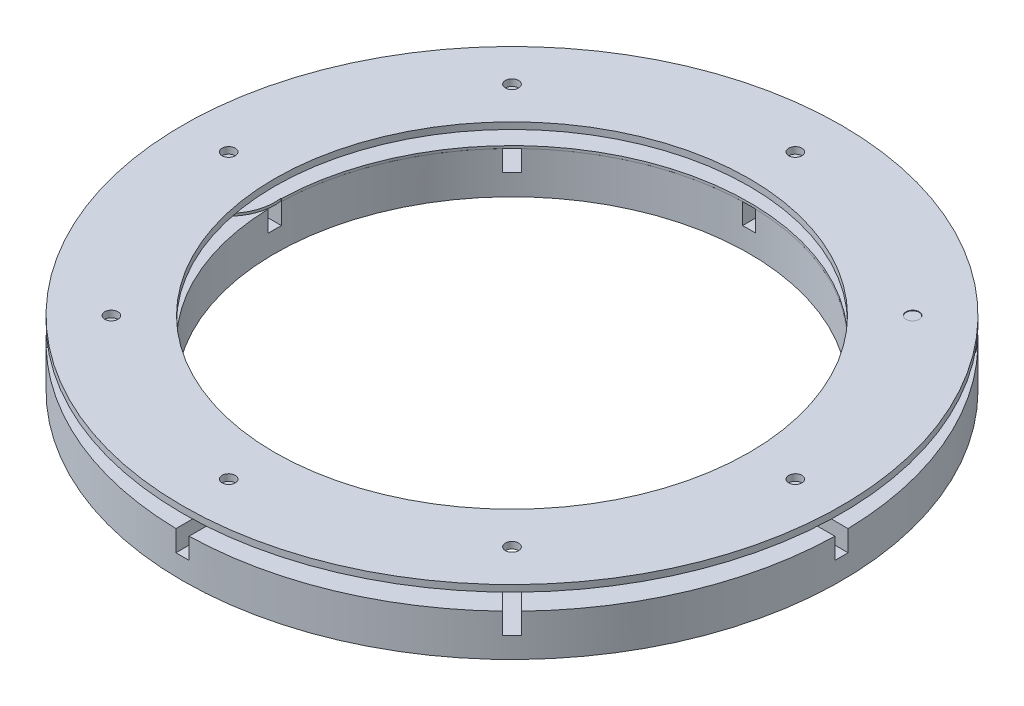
ISO-10303-21;
HEADER;
FILE_DESCRIPTION(('STEP AP214'),'2;1');
FILE_NAME('part.step','',(''),(''),'','','');
FILE_SCHEMA(('AUTOMOTIVE_DESIGN { 1 0 10303 214 1 1 1 1 }'));
ENDSEC;
DATA;
#1=APPLICATION_CONTEXT('core data for automotive mechanical design processes');
#2=APPLICATION_PROTOCOL_DEFINITION('international standard','automotive_design',2000,#1);
#3=PRODUCT_CONTEXT('',#1,'mechanical');
#4=PRODUCT('Part','Part','',(#3));
#5=PRODUCT_RELATED_PRODUCT_CATEGORY('part','',(#4));
#6=PRODUCT_DEFINITION_FORMATION('','',#4);
#7=PRODUCT_DEFINITION_CONTEXT('part definition',#1,'design');
#8=PRODUCT_DEFINITION('design','',#6,#7);
#9=PRODUCT_DEFINITION_SHAPE('','',#8);
#10=(LENGTH_UNIT() NAMED_UNIT(*) SI_UNIT(.MILLI.,.METRE.));
#11=(NAMED_UNIT(*) PLANE_ANGLE_UNIT() SI_UNIT($,.RADIAN.));
#12=(NAMED_UNIT(*) SI_UNIT($,.STERADIAN.) SOLID_ANGLE_UNIT());
#13=UNCERTAINTY_MEASURE_WITH_UNIT(LENGTH_MEASURE(1.E-05),#10,'distance_accuracy_value','');
#14=(GEOMETRIC_REPRESENTATION_CONTEXT(3) GLOBAL_UNCERTAINTY_ASSIGNED_CONTEXT((#13)) GLOBAL_UNIT_ASSIGNED_CONTEXT((#10,
#11,#12)) REPRESENTATION_CONTEXT('',''));
#15=CARTESIAN_POINT('',(0.,0.,0.));
#16=DIRECTION('',(0.,0.,1.));
#17=DIRECTION('',(1.,0.,0.));
#18=AXIS2_PLACEMENT_3D('',#15,#16,#17);
#19=CARTESIAN_POINT('',(0.,3.556,-1.));
#20=DIRECTION('',(0.,0.,-1.));
#21=DIRECTION('',(-1.,0.,0.));
#22=AXIS2_PLACEMENT_3D('',#19,#20,#21);
#23=PLANE('',#22);
#24=DIRECTION('',(1.,0.,0.));
#25=VECTOR('',#24,1.);
#26=CARTESIAN_POINT('',(0.,3.175,-1.));
#27=LINE('',#26,#25);
#28=CARTESIAN_POINT('',(-49.9899989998,3.175,-1.00000000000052));
#29=VERTEX_POINT('',#28);
#30=CARTESIAN_POINT('',(-49.9041866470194,3.175,-1.00000000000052));
#31=VERTEX_POINT('',#30);
#32=EDGE_CURVE('E811',#29,#31,#27,.T.);
#33=ORIENTED_EDGE('',*,*,#32,.T.);
#34=DIRECTION('',(0.,-1.,0.));
#35=VECTOR('',#34,1.);
#36=CARTESIAN_POINT('',(-49.9041866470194,3.556,-1.00000000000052));
#37=LINE('',#36,#35);
#38=CARTESIAN_POINT('',(-49.9041866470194,3.556,-1.00000000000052));
#39=VERTEX_POINT('',#38);
#40=EDGE_CURVE('E728',#39,#31,#37,.T.);
#41=ORIENTED_EDGE('',*,*,#40,.F.);
#42=DIRECTION('',(1.,0.,0.));
#43=VECTOR('',#42,1.);
#44=CARTESIAN_POINT('',(0.,3.556,-1.));
#45=LINE('',#44,#43);
#46=CARTESIAN_POINT('',(-49.9899989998,3.556,-1.00000000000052));
#47=VERTEX_POINT('',#46);
#48=EDGE_CURVE('E821',#47,#39,#45,.T.);
#49=ORIENTED_EDGE('',*,*,#48,.F.);
#50=DIRECTION('',(0.,-1.,0.));
#51=VECTOR('',#50,1.);
#52=CARTESIAN_POINT('',(-49.9899989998,3.556,-1.00000000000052));
#53=LINE('',#52,#51);
#54=EDGE_CURVE('E807',#47,#29,#53,.T.);
#55=ORIENTED_EDGE('',*,*,#54,.T.);
#56=EDGE_LOOP('',(#33,#41,#49,#55));
#57=FACE_BOUND('',#56,.T.);
#58=ADVANCED_FACE('F724',(#57),#23,.F.);
#59=CARTESIAN_POINT('',(-42.9880537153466,3.556,-4.43872369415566E-13));
#60=DIRECTION('',(0.,-1.,0.));
#61=DIRECTION('',(0.,0.,-1.));
#62=AXIS2_PLACEMENT_3D('',#59,#60,#61);
#63=CYLINDRICAL_SURFACE('',#62,6.98805371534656);
#64=CARTESIAN_POINT('',(-42.9880537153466,3.175,-4.43872369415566E-13));
#65=DIRECTION('',(0.,1.,0.));
#66=DIRECTION('',(0.,0.,1.));
#67=AXIS2_PLACEMENT_3D('',#64,#65,#66);
#68=CIRCLE('',#67,6.98805371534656);
#69=CARTESIAN_POINT('',(-36.0719207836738,3.175,-1.00000000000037));
#70=VERTEX_POINT('',#69);
#71=EDGE_CURVE('E814',#31,#70,#68,.T.);
#72=ORIENTED_EDGE('',*,*,#71,.T.);
#73=DIRECTION('',(0.,-1.,0.));
#74=VECTOR('',#73,1.);
#75=CARTESIAN_POINT('',(-36.0719207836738,3.556,-1.00000000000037));
#76=LINE('',#75,#74);
#77=CARTESIAN_POINT('',(-36.0719207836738,3.556,-1.00000000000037));
#78=VERTEX_POINT('',#77);
#79=EDGE_CURVE('E824',#78,#70,#76,.T.);
#80=ORIENTED_EDGE('',*,*,#79,.F.);
#81=CARTESIAN_POINT('',(-42.9880537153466,3.556,-4.43872369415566E-13));
#82=DIRECTION('',(0.,1.,0.));
#83=DIRECTION('',(0.,0.,1.));
#84=AXIS2_PLACEMENT_3D('',#81,#82,#83);
#85=CIRCLE('',#84,6.98805371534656);
#86=EDGE_CURVE('E780',#39,#78,#85,.T.);
#87=ORIENTED_EDGE('',*,*,#86,.F.);
#88=ORIENTED_EDGE('',*,*,#40,.T.);
#89=EDGE_LOOP('',(#72,#80,#87,#88));
#90=FACE_BOUND('',#89,.T.);
#91=ADVANCED_FACE('F726',(#90),#63,.T.);
#92=CARTESIAN_POINT('',(-35.9861084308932,3.175,-1.00000000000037));
#93=VERTEX_POINT('',#92);
#94=EDGE_CURVE('E816',#70,#93,#27,.T.);
#95=ORIENTED_EDGE('',*,*,#94,.T.);
#96=DIRECTION('',(0.,-1.,0.));
#97=VECTOR('',#96,1.);
#98=CARTESIAN_POINT('',(-35.9861084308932,3.556,-1.00000000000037));
#99=LINE('',#98,#97);
#100=CARTESIAN_POINT('',(-35.9861084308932,3.556,-1.00000000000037));
#101=VERTEX_POINT('',#100);
#102=EDGE_CURVE('E802',#101,#93,#99,.T.);
#103=ORIENTED_EDGE('',*,*,#102,.F.);
#104=EDGE_CURVE('E793',#78,#101,#45,.T.);
#105=ORIENTED_EDGE('',*,*,#104,.F.);
#106=ORIENTED_EDGE('',*,*,#79,.T.);
#107=EDGE_LOOP('',(#95,#103,#105,#106));
#108=FACE_BOUND('',#107,.T.);
#109=ADVANCED_FACE('F834',(#108),#23,.F.);
#110=CARTESIAN_POINT('',(0.,3.556,0.));
#111=DIRECTION('',(0.,-1.,0.));
#112=DIRECTION('',(0.,0.,-1.));
#113=AXIS2_PLACEMENT_3D('',#110,#111,#112);
#114=CYLINDRICAL_SURFACE('',#113,36.);
#115=CARTESIAN_POINT('',(0.,3.175,0.));
#116=DIRECTION('',(0.,1.,0.));
#117=DIRECTION('',(0.,0.,1.));
#118=AXIS2_PLACEMENT_3D('',#115,#116,#117);
#119=CIRCLE('',#118,36.);
#120=CARTESIAN_POINT('',(25.8273295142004,3.175,-25.0788566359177));
#121=VERTEX_POINT('',#120);
#122=EDGE_CURVE('E801',#93,#121,#119,.F.);
#123=ORIENTED_EDGE('',*,*,#122,.T.);
#124=DIRECTION('',(0.,-1.,0.));
#125=VECTOR('',#124,1.);
#126=CARTESIAN_POINT('',(25.8273295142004,3.556,-25.0788566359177));
#127=LINE('',#126,#125);
#128=CARTESIAN_POINT('',(25.8273295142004,3.556,-25.0788566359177));
#129=VERTEX_POINT('',#128);
#130=EDGE_CURVE('E798',#129,#121,#127,.T.);
#131=ORIENTED_EDGE('',*,*,#130,.F.);
#132=CARTESIAN_POINT('',(0.,3.556,0.));
#133=DIRECTION('',(0.,1.,0.));
#134=DIRECTION('',(0.,0.,1.));
#135=AXIS2_PLACEMENT_3D('',#132,#133,#134);
#136=CIRCLE('',#135,36.);
#137=EDGE_CURVE('E787',#101,#129,#136,.F.);
#138=ORIENTED_EDGE('',*,*,#137,.F.);
#139=ORIENTED_EDGE('',*,*,#102,.T.);
#140=EDGE_LOOP('',(#123,#131,#138,#139));
#141=FACE_BOUND('',#140,.T.);
#142=ADVANCED_FACE('F799',(#141),#114,.F.);
#143=CARTESIAN_POINT('',(30.3971442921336,3.556,-30.3971442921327));
#144=DIRECTION('',(0.,-1.,0.));
#145=DIRECTION('',(0.,0.,-1.));
#146=AXIS2_PLACEMENT_3D('',#143,#144,#145);
#147=CYLINDRICAL_SURFACE('',#146,7.01194628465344);
#148=CARTESIAN_POINT('',(30.3971442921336,3.175,-30.3971442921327));
#149=DIRECTION('',(0.,1.,0.));
#150=DIRECTION('',(0.,0.,1.));
#151=AXIS2_PLACEMENT_3D('',#148,#149,#150);
#152=CIRCLE('',#151,7.01194628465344);
#153=CARTESIAN_POINT('',(35.355339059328,3.175,-35.3553390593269));
#154=VERTEX_POINT('',#153);
#155=EDGE_CURVE('E765',#121,#154,#152,.T.);
#156=ORIENTED_EDGE('',*,*,#155,.T.);
#157=DIRECTION('',(0.,-1.,0.));
#158=VECTOR('',#157,1.);
#159=CARTESIAN_POINT('',(35.355339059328,3.556,-35.3553390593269));
#160=LINE('',#159,#158);
#161=CARTESIAN_POINT('',(35.355339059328,3.556,-35.3553390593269));
#162=VERTEX_POINT('',#161);
#163=EDGE_CURVE('E803',#162,#154,#160,.T.);
#164=ORIENTED_EDGE('',*,*,#163,.F.);
#165=CARTESIAN_POINT('',(30.3971442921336,3.556,-30.3971442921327));
#166=DIRECTION('',(0.,1.,0.));
#167=DIRECTION('',(0.,0.,1.));
#168=AXIS2_PLACEMENT_3D('',#165,#166,#167);
#169=CIRCLE('',#168,7.01194628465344);
#170=EDGE_CURVE('E791',#129,#162,#169,.T.);
#171=ORIENTED_EDGE('',*,*,#170,.F.);
#172=ORIENTED_EDGE('',*,*,#130,.T.);
#173=EDGE_LOOP('',(#156,#164,#171,#172));
#174=FACE_BOUND('',#173,.T.);
#175=ADVANCED_FACE('F805',(#174),#147,.T.);
#176=CARTESIAN_POINT('',(0.,3.556,0.));
#177=DIRECTION('',(0.,-1.,0.));
#178=DIRECTION('',(0.,0.,-1.));
#179=AXIS2_PLACEMENT_3D('',#176,#177,#178);
#180=CYLINDRICAL_SURFACE('',#179,50.);
#181=CARTESIAN_POINT('',(0.,3.175,0.));
#182=DIRECTION('',(0.,1.,0.));
#183=DIRECTION('',(0.,0.,1.));
#184=AXIS2_PLACEMENT_3D('',#181,#182,#183);
#185=CIRCLE('',#184,50.);
#186=EDGE_CURVE('E771',#154,#29,#185,.T.);
#187=ORIENTED_EDGE('',*,*,#186,.T.);
#188=ORIENTED_EDGE('',*,*,#54,.F.);
#189=CARTESIAN_POINT('',(0.,3.556,0.));
#190=DIRECTION('',(0.,1.,0.));
#191=DIRECTION('',(0.,0.,1.));
#192=AXIS2_PLACEMENT_3D('',#189,#190,#191);
#193=CIRCLE('',#192,50.);
#194=EDGE_CURVE('E742',#162,#47,#193,.T.);
#195=ORIENTED_EDGE('',*,*,#194,.F.);
#196=ORIENTED_EDGE('',*,*,#163,.T.);
#197=EDGE_LOOP('',(#187,#188,#195,#196));
#198=FACE_BOUND('',#197,.T.);
#199=ADVANCED_FACE('F864',(#198),#180,.T.);
#200=CARTESIAN_POINT('',(0.,3.556,0.));
#201=DIRECTION('',(0.,1.,0.));
#202=DIRECTION('',(0.,0.,1.));
#203=AXIS2_PLACEMENT_3D('',#200,#201,#202);
#204=PLANE('',#203);
#205=CARTESIAN_POINT('',(30.3971442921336,3.556,-30.3971442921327));
#206=DIRECTION('',(0.,1.,0.));
#207=DIRECTION('',(0.,0.,1.));
#208=AXIS2_PLACEMENT_3D('',#205,#206,#207);
#209=CIRCLE('',#208,0.975);
#210=CARTESIAN_POINT('',(30.3971442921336,3.556,-31.3721442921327));
#211=VERTEX_POINT('',#210);
#212=EDGE_CURVE('E837',#211,#211,#209,.T.);
#213=ORIENTED_EDGE('',*,*,#212,.F.);
#214=EDGE_LOOP('',(#213));
#215=FACE_BOUND('',#214,.T.);
#216=ORIENTED_EDGE('',*,*,#48,.T.);
#217=ORIENTED_EDGE('',*,*,#86,.T.);
#218=ORIENTED_EDGE('',*,*,#104,.T.);
#219=ORIENTED_EDGE('',*,*,#137,.T.);
#220=ORIENTED_EDGE('',*,*,#170,.T.);
#221=ORIENTED_EDGE('',*,*,#194,.T.);
#222=EDGE_LOOP('',(#216,#217,#218,#219,#220,#221));
#223=FACE_BOUND('',#222,.T.);
#224=ADVANCED_FACE('F789',(#215,#223),#204,.T.);
#225=CARTESIAN_POINT('',(0.,3.175,0.));
#226=DIRECTION('',(0.,1.,0.));
#227=DIRECTION('',(0.,0.,1.));
#228=AXIS2_PLACEMENT_3D('',#225,#226,#227);
#229=PLANE('',#228);
#230=CARTESIAN_POINT('',(-42.9880537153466,3.175,-4.43872369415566E-13));
#231=DIRECTION('',(0.,-1.,0.));
#232=DIRECTION('',(0.,0.,-1.));
#233=AXIS2_PLACEMENT_3D('',#230,#231,#232);
#234=CIRCLE('',#233,0.974999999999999);
#235=CARTESIAN_POINT('',(-42.9880537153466,3.175,0.974999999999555));
#236=VERTEX_POINT('',#235);
#237=EDGE_CURVE('E13',#236,#236,#234,.T.);
#238=ORIENTED_EDGE('',*,*,#237,.F.);
#239=EDGE_LOOP('',(#238));
#240=FACE_BOUND('',#239,.T.);
#241=ORIENTED_EDGE('',*,*,#32,.F.);
#242=ORIENTED_EDGE('',*,*,#186,.F.);
#243=ORIENTED_EDGE('',*,*,#155,.F.);
#244=ORIENTED_EDGE('',*,*,#122,.F.);
#245=ORIENTED_EDGE('',*,*,#94,.F.);
#246=ORIENTED_EDGE('',*,*,#71,.F.);
#247=EDGE_LOOP('',(#241,#242,#243,#244,#245,#246));
#248=FACE_BOUND('',#247,.T.);
#249=ADVANCED_FACE('F833',(#240,#248),#229,.F.);
#250=CARTESIAN_POINT('',(30.3971442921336,6.604,-30.3971442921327));
#251=DIRECTION('',(0.,-1.,0.));
#252=DIRECTION('',(0.,0.,-1.));
#253=AXIS2_PLACEMENT_3D('',#250,#251,#252);
#254=CYLINDRICAL_SURFACE('',#253,0.975);
#255=CARTESIAN_POINT('',(30.3971442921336,6.604,-30.3971442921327));
#256=DIRECTION('',(0.,1.,0.));
#257=DIRECTION('',(0.,0.,1.));
#258=AXIS2_PLACEMENT_3D('',#255,#256,#257);
#259=CIRCLE('',#258,0.975);
#260=CARTESIAN_POINT('',(30.3971442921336,6.604,-31.3721442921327));
#261=VERTEX_POINT('',#260);
#262=EDGE_CURVE('E815',#261,#261,#259,.T.);
#263=CARTESIAN_POINT('',(30.3971442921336,6.604,-31.3721442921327));
#264=CARTESIAN_POINT('',(30.3971442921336,6.57225,-31.3721442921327));
#265=CARTESIAN_POINT('',(30.3971442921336,6.5405,-31.3721442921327));
#266=CARTESIAN_POINT('',(30.3971442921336,6.477,-31.3721442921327));
#267=CARTESIAN_POINT('',(30.3971442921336,6.44525,-31.3721442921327));
#268=CARTESIAN_POINT('',(30.3971442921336,6.38175,-31.3721442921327));
#269=CARTESIAN_POINT('',(30.3971442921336,6.35,-31.3721442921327));
#270=CARTESIAN_POINT('',(30.3971442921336,6.2865,-31.3721442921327));
#271=CARTESIAN_POINT('',(30.3971442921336,6.25475,-31.3721442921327));
#272=CARTESIAN_POINT('',(30.3971442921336,6.19125,-31.3721442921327));
#273=CARTESIAN_POINT('',(30.3971442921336,6.1595,-31.3721442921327));
#274=CARTESIAN_POINT('',(30.3971442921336,6.096,-31.3721442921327));
#275=CARTESIAN_POINT('',(30.3971442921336,6.06425,-31.3721442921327));
#276=CARTESIAN_POINT('',(30.3971442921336,6.00075,-31.3721442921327));
#277=CARTESIAN_POINT('',(30.3971442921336,5.969,-31.3721442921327));
#278=CARTESIAN_POINT('',(30.3971442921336,5.9055,-31.3721442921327));
#279=CARTESIAN_POINT('',(30.3971442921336,5.87375,-31.3721442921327));
#280=CARTESIAN_POINT('',(30.3971442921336,5.81025,-31.3721442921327));
#281=CARTESIAN_POINT('',(30.3971442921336,5.7785,-31.3721442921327));
#282=CARTESIAN_POINT('',(30.3971442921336,5.715,-31.3721442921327));
#283=CARTESIAN_POINT('',(30.3971442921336,5.68325,-31.3721442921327));
#284=CARTESIAN_POINT('',(30.3971442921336,5.61975,-31.3721442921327));
#285=CARTESIAN_POINT('',(30.3971442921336,5.588,-31.3721442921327));
#286=CARTESIAN_POINT('',(30.3971442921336,5.5245,-31.3721442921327));
#287=CARTESIAN_POINT('',(30.3971442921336,5.49275,-31.3721442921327));
#288=CARTESIAN_POINT('',(30.3971442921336,5.42925,-31.3721442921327));
#289=CARTESIAN_POINT('',(30.3971442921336,5.3975,-31.3721442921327));
#290=CARTESIAN_POINT('',(30.3971442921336,5.334,-31.3721442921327));
#291=CARTESIAN_POINT('',(30.3971442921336,5.30225,-31.3721442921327));
#292=CARTESIAN_POINT('',(30.3971442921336,5.23875,-31.3721442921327));
#293=CARTESIAN_POINT('',(30.3971442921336,5.207,-31.3721442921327));
#294=CARTESIAN_POINT('',(30.3971442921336,5.1435,-31.3721442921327));
#295=CARTESIAN_POINT('',(30.3971442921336,5.11175,-31.3721442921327));
#296=CARTESIAN_POINT('',(30.3971442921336,5.04825,-31.3721442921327));
#297=CARTESIAN_POINT('',(30.3971442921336,5.0165,-31.3721442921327));
#298=CARTESIAN_POINT('',(30.3971442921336,4.953,-31.3721442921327));
#299=CARTESIAN_POINT('',(30.3971442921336,4.92125,-31.3721442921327));
#300=CARTESIAN_POINT('',(30.3971442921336,4.85775,-31.3721442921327));
#301=CARTESIAN_POINT('',(30.3971442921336,4.826,-31.3721442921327));
#302=CARTESIAN_POINT('',(30.3971442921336,4.7625,-31.3721442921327));
#303=CARTESIAN_POINT('',(30.3971442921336,4.73075,-31.3721442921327));
#304=CARTESIAN_POINT('',(30.3971442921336,4.66725,-31.3721442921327));
#305=CARTESIAN_POINT('',(30.3971442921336,4.6355,-31.3721442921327));
#306=CARTESIAN_POINT('',(30.3971442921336,4.572,-31.3721442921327));
#307=CARTESIAN_POINT('',(30.3971442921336,4.54025,-31.3721442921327));
#308=CARTESIAN_POINT('',(30.3971442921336,4.47675,-31.3721442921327));
#309=CARTESIAN_POINT('',(30.3971442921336,4.445,-31.3721442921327));
#310=CARTESIAN_POINT('',(30.3971442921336,4.3815,-31.3721442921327));
#311=CARTESIAN_POINT('',(30.3971442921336,4.34975,-31.3721442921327));
#312=CARTESIAN_POINT('',(30.3971442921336,4.28625,-31.3721442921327));
#313=CARTESIAN_POINT('',(30.3971442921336,4.2545,-31.3721442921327));
#314=CARTESIAN_POINT('',(30.3971442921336,4.191,-31.3721442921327));
#315=CARTESIAN_POINT('',(30.3971442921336,4.15925,-31.3721442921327));
#316=CARTESIAN_POINT('',(30.3971442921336,4.09575,-31.3721442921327));
#317=CARTESIAN_POINT('',(30.3971442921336,4.064,-31.3721442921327));
#318=CARTESIAN_POINT('',(30.3971442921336,4.0005,-31.3721442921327));
#319=CARTESIAN_POINT('',(30.3971442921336,3.96875,-31.3721442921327));
#320=CARTESIAN_POINT('',(30.3971442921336,3.90525,-31.3721442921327));
#321=CARTESIAN_POINT('',(30.3971442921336,3.8735,-31.3721442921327));
#322=CARTESIAN_POINT('',(30.3971442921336,3.81,-31.3721442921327));
#323=CARTESIAN_POINT('',(30.3971442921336,3.77825,-31.3721442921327));
#324=CARTESIAN_POINT('',(30.3971442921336,3.71475,-31.3721442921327));
#325=CARTESIAN_POINT('',(30.3971442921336,3.683,-31.3721442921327));
#326=CARTESIAN_POINT('',(30.3971442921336,3.6195,-31.3721442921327));
#327=CARTESIAN_POINT('',(30.3971442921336,3.58775,-31.3721442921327));
#328=CARTESIAN_POINT('',(30.3971442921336,3.556,-31.3721442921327));
#329=B_SPLINE_CURVE_WITH_KNOTS('',3,(#263,#264,#265,#266,#267,#268,#269,#270,#271,#272,#273,
#274,#275,#276,#277,#278,#279,#280,#281,#282,#283,#284,#285,#286,#287,#288,#289,#290,#291,#292,
#293,#294,#295,#296,#297,#298,#299,#300,#301,#302,#303,#304,#305,#306,#307,#308,#309,#310,#311,
#312,#313,#314,#315,#316,#317,#318,#319,#320,#321,#322,#323,#324,#325,#326,#327,#328),
.UNSPECIFIED.,.F.,.F.,(4,2,2,2,2,2,2,2,2,2,2,2,2,2,2,2,2,2,2,2,2,2,2,2,2,2,2,2,2,2,2,2,4),(0.,
0.0952500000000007,0.190500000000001,0.28575,0.381,0.47625,0.5715,0.666750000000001,
0.762000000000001,0.85725,0.9525,1.04775,1.143,1.23825,1.3335,1.42875,1.524,1.61925,1.7145,
1.80975,1.905,2.00025,2.0955,2.19075,2.286,2.38125,2.4765,2.57175,2.667,2.76225,2.8575,2.95275,
3.048),.UNSPECIFIED.);
#330=EDGE_CURVE('BSEAM856',#261,#211,#329,.T.);
#331=ORIENTED_EDGE('',*,*,#262,.F.);
#332=ORIENTED_EDGE('',*,*,#212,.T.);
#333=ORIENTED_EDGE('',*,*,#330,.T.);
#334=ORIENTED_EDGE('',*,*,#330,.F.);
#335=EDGE_LOOP('',(#331,#333,#332,#334));
#336=FACE_BOUND('',#335,.T.);
#337=ADVANCED_FACE('F856',(#336),#254,.T.);
#338=CARTESIAN_POINT('',(30.3971442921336,6.604,-30.3971442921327));
#339=DIRECTION('',(0.,1.,0.));
#340=DIRECTION('',(0.,0.,1.));
#341=AXIS2_PLACEMENT_3D('',#338,#339,#340);
#342=PLANE('',#341);
#343=ORIENTED_EDGE('',*,*,#262,.T.);
#344=EDGE_LOOP('',(#343));
#345=FACE_BOUND('',#344,.T.);
#346=ADVANCED_FACE('F851',(#345),#342,.T.);
#347=CARTESIAN_POINT('',(-42.9880537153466,0.127,-4.43872369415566E-13));
#348=DIRECTION('',(0.,1.,0.));
#349=DIRECTION('',(0.,0.,1.));
#350=AXIS2_PLACEMENT_3D('',#347,#348,#349);
#351=CYLINDRICAL_SURFACE('',#350,0.974999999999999);
#352=CARTESIAN_POINT('',(-42.9880537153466,0.127,-4.43872369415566E-13));
#353=DIRECTION('',(0.,-1.,0.));
#354=DIRECTION('',(0.,0.,-1.));
#355=AXIS2_PLACEMENT_3D('',#352,#353,#354);
#356=CIRCLE('',#355,0.974999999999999);
#357=CARTESIAN_POINT('',(-42.9880537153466,0.127,0.974999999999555));
#358=VERTEX_POINT('',#357);
#359=EDGE_CURVE('E840',#358,#358,#356,.T.);
#360=CARTESIAN_POINT('',(-42.9880537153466,0.127,0.974999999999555));
#361=CARTESIAN_POINT('',(-42.9880537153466,0.15875,0.974999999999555));
#362=CARTESIAN_POINT('',(-42.9880537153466,0.1905,0.974999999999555));
#363=CARTESIAN_POINT('',(-42.9880537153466,0.254,0.974999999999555));
#364=CARTESIAN_POINT('',(-42.9880537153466,0.28575,0.974999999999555));
#365=CARTESIAN_POINT('',(-42.9880537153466,0.34925,0.974999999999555));
#366=CARTESIAN_POINT('',(-42.9880537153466,0.381,0.974999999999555));
#367=CARTESIAN_POINT('',(-42.9880537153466,0.4445,0.974999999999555));
#368=CARTESIAN_POINT('',(-42.9880537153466,0.47625,0.974999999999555));
#369=CARTESIAN_POINT('',(-42.9880537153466,0.53975,0.974999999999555));
#370=CARTESIAN_POINT('',(-42.9880537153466,0.5715,0.974999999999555));
#371=CARTESIAN_POINT('',(-42.9880537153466,0.635,0.974999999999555));
#372=CARTESIAN_POINT('',(-42.9880537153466,0.66675,0.974999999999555));
#373=CARTESIAN_POINT('',(-42.9880537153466,0.73025,0.974999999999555));
#374=CARTESIAN_POINT('',(-42.9880537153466,0.762,0.974999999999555));
#375=CARTESIAN_POINT('',(-42.9880537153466,0.8255,0.974999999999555));
#376=CARTESIAN_POINT('',(-42.9880537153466,0.85725,0.974999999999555));
#377=CARTESIAN_POINT('',(-42.9880537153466,0.92075,0.974999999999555));
#378=CARTESIAN_POINT('',(-42.9880537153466,0.9525,0.974999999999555));
#379=CARTESIAN_POINT('',(-42.9880537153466,1.016,0.974999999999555));
#380=CARTESIAN_POINT('',(-42.9880537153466,1.04775,0.974999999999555));
#381=CARTESIAN_POINT('',(-42.9880537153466,1.11125,0.974999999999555));
#382=CARTESIAN_POINT('',(-42.9880537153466,1.143,0.974999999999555));
#383=CARTESIAN_POINT('',(-42.9880537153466,1.2065,0.974999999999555));
#384=CARTESIAN_POINT('',(-42.9880537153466,1.23825,0.974999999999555));
#385=CARTESIAN_POINT('',(-42.9880537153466,1.30175,0.974999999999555));
#386=CARTESIAN_POINT('',(-42.9880537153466,1.3335,0.974999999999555));
#387=CARTESIAN_POINT('',(-42.9880537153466,1.397,0.974999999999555));
#388=CARTESIAN_POINT('',(-42.9880537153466,1.42875,0.974999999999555));
#389=CARTESIAN_POINT('',(-42.9880537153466,1.49225,0.974999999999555));
#390=CARTESIAN_POINT('',(-42.9880537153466,1.524,0.974999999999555));
#391=CARTESIAN_POINT('',(-42.9880537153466,1.5875,0.974999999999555));
#392=CARTESIAN_POINT('',(-42.9880537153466,1.61925,0.974999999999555));
#393=CARTESIAN_POINT('',(-42.9880537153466,1.68275,0.974999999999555));
#394=CARTESIAN_POINT('',(-42.9880537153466,1.7145,0.974999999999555));
#395=CARTESIAN_POINT('',(-42.9880537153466,1.778,0.974999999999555));
#396=CARTESIAN_POINT('',(-42.9880537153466,1.80975,0.974999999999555));
#397=CARTESIAN_POINT('',(-42.9880537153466,1.87325,0.974999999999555));
#398=CARTESIAN_POINT('',(-42.9880537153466,1.905,0.974999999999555));
#399=CARTESIAN_POINT('',(-42.9880537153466,1.9685,0.974999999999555));
#400=CARTESIAN_POINT('',(-42.9880537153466,2.00025,0.974999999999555));
#401=CARTESIAN_POINT('',(-42.9880537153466,2.06375,0.974999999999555));
#402=CARTESIAN_POINT('',(-42.9880537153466,2.0955,0.974999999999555));
#403=CARTESIAN_POINT('',(-42.9880537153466,2.159,0.974999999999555));
#404=CARTESIAN_POINT('',(-42.9880537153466,2.19075,0.974999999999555));
#405=CARTESIAN_POINT('',(-42.9880537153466,2.25425,0.974999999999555));
#406=CARTESIAN_POINT('',(-42.9880537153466,2.286,0.974999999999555));
#407=CARTESIAN_POINT('',(-42.9880537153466,2.3495,0.974999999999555));
#408=CARTESIAN_POINT('',(-42.9880537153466,2.38125,0.974999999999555));
#409=CARTESIAN_POINT('',(-42.9880537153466,2.44475,0.974999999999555));
#410=CARTESIAN_POINT('',(-42.9880537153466,2.4765,0.974999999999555));
#411=CARTESIAN_POINT('',(-42.9880537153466,2.54,0.974999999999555));
#412=CARTESIAN_POINT('',(-42.9880537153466,2.57175,0.974999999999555));
#413=CARTESIAN_POINT('',(-42.9880537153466,2.63525,0.974999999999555));
#414=CARTESIAN_POINT('',(-42.9880537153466,2.667,0.974999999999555));
#415=CARTESIAN_POINT('',(-42.9880537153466,2.7305,0.974999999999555));
#416=CARTESIAN_POINT('',(-42.9880537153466,2.76225,0.974999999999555));
#417=CARTESIAN_POINT('',(-42.9880537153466,2.82575,0.974999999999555));
#418=CARTESIAN_POINT('',(-42.9880537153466,2.8575,0.974999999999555));
#419=CARTESIAN_POINT('',(-42.9880537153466,2.921,0.974999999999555));
#420=CARTESIAN_POINT('',(-42.9880537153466,2.95275,0.974999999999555));
#421=CARTESIAN_POINT('',(-42.9880537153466,3.01625,0.974999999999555));
#422=CARTESIAN_POINT('',(-42.9880537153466,3.048,0.974999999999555));
#423=CARTESIAN_POINT('',(-42.9880537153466,3.1115,0.974999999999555));
#424=CARTESIAN_POINT('',(-42.9880537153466,3.14325,0.974999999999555));
#425=CARTESIAN_POINT('',(-42.9880537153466,3.175,0.974999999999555));
#426=B_SPLINE_CURVE_WITH_KNOTS('',3,(#360,#361,#362,#363,#364,#365,#366,#367,#368,#369,#370,
#371,#372,#373,#374,#375,#376,#377,#378,#379,#380,#381,#382,#383,#384,#385,#386,#387,#388,#389,
#390,#391,#392,#393,#394,#395,#396,#397,#398,#399,#400,#401,#402,#403,#404,#405,#406,#407,#408,
#409,#410,#411,#412,#413,#414,#415,#416,#417,#418,#419,#420,#421,#422,#423,#424,#425),
.UNSPECIFIED.,.F.,.F.,(4,2,2,2,2,2,2,2,2,2,2,2,2,2,2,2,2,2,2,2,2,2,2,2,2,2,2,2,2,2,2,2,4),(0.,
0.09525,0.1905,0.28575,0.381,0.47625,0.5715,0.66675,0.762,0.85725,0.9525,1.04775,1.143,1.23825,
1.3335,1.42875,1.524,1.61925,1.7145,1.80975,1.905,2.00025,2.0955,2.19075,2.286,2.38125,2.4765,
2.57175,2.667,2.76225,2.8575,2.95275,3.048),.UNSPECIFIED.);
#427=EDGE_CURVE('BSEAM848',#358,#236,#426,.T.);
#428=ORIENTED_EDGE('',*,*,#359,.F.);
#429=ORIENTED_EDGE('',*,*,#237,.T.);
#430=ORIENTED_EDGE('',*,*,#427,.T.);
#431=ORIENTED_EDGE('',*,*,#427,.F.);
#432=EDGE_LOOP('',(#428,#430,#429,#431));
#433=FACE_BOUND('',#432,.T.);
#434=ADVANCED_FACE('F848',(#433),#351,.T.);
#435=CARTESIAN_POINT('',(0.,0.127,0.));
#436=DIRECTION('',(0.,-1.,0.));
#437=DIRECTION('',(0.,0.,-1.));
#438=AXIS2_PLACEMENT_3D('',#435,#436,#437);
#439=PLANE('',#438);
#440=ORIENTED_EDGE('',*,*,#359,.T.);
#441=EDGE_LOOP('',(#440));
#442=FACE_BOUND('',#441,.T.);
#443=ADVANCED_FACE('F846',(#442),#439,.T.);
#444=CLOSED_SHELL('',(#58,#91,#109,#142,#175,#199,#224,#249,#337,#346,#434,#443));
#445=MANIFOLD_SOLID_BREP('B2',#444);
#446=CARTESIAN_POINT('',(0.,3.175,0.));
#447=DIRECTION('',(0.,1.,0.));
#448=DIRECTION('',(0.,0.,1.));
#449=AXIS2_PLACEMENT_3D('',#446,#447,#448);
#450=PLANE('',#449);
#451=CARTESIAN_POINT('',(0.,3.175,0.));
#452=DIRECTION('',(0.,1.,0.));
#453=DIRECTION('',(0.,0.,1.));
#454=AXIS2_PLACEMENT_3D('',#451,#452,#453);
#455=CIRCLE('',#454,36.);
#456=CARTESIAN_POINT('',(-1.,3.175,-35.9861084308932));
#457=VERTEX_POINT('',#456);
#458=CARTESIAN_POINT('',(-24.7389145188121,3.175,-26.1531280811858));
#459=VERTEX_POINT('',#458);
#460=EDGE_CURVE('E1430',#457,#459,#455,.T.);
#461=ORIENTED_EDGE('',*,*,#460,.F.);
#462=DIRECTION('',(0.,0.,-1.));
#463=VECTOR('',#462,1.);
#464=CARTESIAN_POINT('',(-1.,3.175,0.));
#465=LINE('',#464,#463);
#466=CARTESIAN_POINT('',(-1.,3.175,-49.9899989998));
#467=VERTEX_POINT('',#466);
#468=EDGE_CURVE('E1342',#457,#467,#465,.T.);
#469=ORIENTED_EDGE('',*,*,#468,.T.);
#470=CARTESIAN_POINT('',(0.,3.175,0.));
#471=DIRECTION('',(0.,1.,0.));
#472=DIRECTION('',(0.,0.,1.));
#473=AXIS2_PLACEMENT_3D('',#470,#471,#472);
#474=CIRCLE('',#473,50.);
#475=CARTESIAN_POINT('',(-34.6411605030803,3.175,-36.0553740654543));
#476=VERTEX_POINT('',#475);
#477=EDGE_CURVE('E1428',#467,#476,#474,.T.);
#478=ORIENTED_EDGE('',*,*,#477,.T.);
#479=DIRECTION('',(-0.707106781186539,0.,-0.707106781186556));
#480=VECTOR('',#479,1.);
#481=CARTESIAN_POINT('',(0.707106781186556,3.175,-0.707106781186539));
#482=LINE('',#481,#480);
#483=EDGE_CURVE('E1328',#459,#476,#482,.T.);
#484=ORIENTED_EDGE('',*,*,#483,.F.);
#485=EDGE_LOOP('',(#461,#469,#478,#484));
#486=FACE_BOUND('',#485,.T.);
#487=ADVANCED_FACE('F991',(#486),#450,.T.);
#488=CARTESIAN_POINT('',(0.999999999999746,3.175,35.9861084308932));
#489=VERTEX_POINT('',#488);
#490=CARTESIAN_POINT('',(24.7389145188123,3.175,26.1531280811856));
#491=VERTEX_POINT('',#490);
#492=EDGE_CURVE('E1410',#489,#491,#455,.T.);
#493=ORIENTED_EDGE('',*,*,#492,.F.);
#494=DIRECTION('',(0.,0.,1.));
#495=VECTOR('',#494,1.);
#496=CARTESIAN_POINT('',(1.,3.175,0.));
#497=LINE('',#496,#495);
#498=CARTESIAN_POINT('',(0.999999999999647,3.175,49.9899989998));
#499=VERTEX_POINT('',#498);
#500=EDGE_CURVE('E1302',#489,#499,#497,.T.);
#501=ORIENTED_EDGE('',*,*,#500,.T.);
#502=CARTESIAN_POINT('',(34.6411605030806,3.175,36.055374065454));
#503=VERTEX_POINT('',#502);
#504=EDGE_CURVE('E1405',#499,#503,#474,.T.);
#505=ORIENTED_EDGE('',*,*,#504,.T.);
#506=DIRECTION('',(0.707106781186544,0.,0.707106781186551));
#507=VECTOR('',#506,1.);
#508=CARTESIAN_POINT('',(-0.707106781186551,3.175,0.707106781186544));
#509=LINE('',#508,#507);
#510=EDGE_CURVE('E1288',#491,#503,#509,.T.);
#511=ORIENTED_EDGE('',*,*,#510,.F.);
#512=EDGE_LOOP('',(#493,#501,#505,#511));
#513=FACE_BOUND('',#512,.T.);
#514=ADVANCED_FACE('F1507',(#513),#450,.T.);
#515=DIRECTION('',(0.,0.,1.));
#516=VECTOR('',#515,1.);
#517=CARTESIAN_POINT('',(-1.,3.175,0.));
#518=LINE('',#517,#516);
#519=CARTESIAN_POINT('',(-1.00000000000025,3.175,35.9861084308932));
#520=VERTEX_POINT('',#519);
#521=CARTESIAN_POINT('',(-1.00000000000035,3.175,49.9899989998));
#522=VERTEX_POINT('',#521);
#523=EDGE_CURVE('E1299',#520,#522,#518,.T.);
#524=ORIENTED_EDGE('',*,*,#523,.F.);
#525=CARTESIAN_POINT('',(-24.7389145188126,3.175,26.1531280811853));
#526=VERTEX_POINT('',#525);
#527=EDGE_CURVE('E1417',#526,#520,#455,.T.);
#528=ORIENTED_EDGE('',*,*,#527,.F.);
#529=DIRECTION('',(-0.707106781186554,0.,0.707106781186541));
#530=VECTOR('',#529,1.);
#531=CARTESIAN_POINT('',(0.707106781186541,3.175,0.707106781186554));
#532=LINE('',#531,#530);
#533=CARTESIAN_POINT('',(-34.6411605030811,3.175,36.0553740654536));
#534=VERTEX_POINT('',#533);
#535=EDGE_CURVE('E1309',#526,#534,#532,.T.);
#536=ORIENTED_EDGE('',*,*,#535,.T.);
#537=EDGE_CURVE('E1409',#534,#522,#474,.T.);
#538=ORIENTED_EDGE('',*,*,#537,.T.);
#539=EDGE_LOOP('',(#524,#528,#536,#538));
#540=FACE_BOUND('',#539,.T.);
#541=ADVANCED_FACE('F1448',(#540),#450,.T.);
#542=CARTESIAN_POINT('',(26.1531280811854,3.175,24.7389145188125));
#543=VERTEX_POINT('',#542);
#544=CARTESIAN_POINT('',(35.9861084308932,3.175,1.00000000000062));
#545=VERTEX_POINT('',#544);
#546=EDGE_CURVE('E1420',#543,#545,#455,.T.);
#547=ORIENTED_EDGE('',*,*,#546,.F.);
#548=DIRECTION('',(0.707106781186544,0.,0.707106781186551));
#549=VECTOR('',#548,1.);
#550=CARTESIAN_POINT('',(0.707106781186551,3.175,-0.707106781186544));
#551=LINE('',#550,#549);
#552=CARTESIAN_POINT('',(36.0553740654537,3.175,34.6411605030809));
#553=VERTEX_POINT('',#552);
#554=EDGE_CURVE('E1291',#543,#553,#551,.T.);
#555=ORIENTED_EDGE('',*,*,#554,.T.);
#556=CARTESIAN_POINT('',(49.9899989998,3.175,1.00000000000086));
#557=VERTEX_POINT('',#556);
#558=EDGE_CURVE('E1413',#553,#557,#474,.T.);
#559=ORIENTED_EDGE('',*,*,#558,.T.);
#560=DIRECTION('',(1.,0.,0.));
#561=VECTOR('',#560,1.);
#562=CARTESIAN_POINT('',(0.,3.175,1.));
#563=LINE('',#562,#561);
#564=EDGE_CURVE('E1278',#545,#557,#563,.T.);
#565=ORIENTED_EDGE('',*,*,#564,.F.);
#566=EDGE_LOOP('',(#547,#555,#559,#565));
#567=FACE_BOUND('',#566,.T.);
#568=ADVANCED_FACE('F1481',(#567),#450,.T.);
#569=DIRECTION('',(-0.707106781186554,0.,0.707106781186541));
#570=VECTOR('',#569,1.);
#571=CARTESIAN_POINT('',(-0.707106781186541,3.175,-0.707106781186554));
#572=LINE('',#571,#570);
#573=CARTESIAN_POINT('',(-26.1531280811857,3.175,24.7389145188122));
#574=VERTEX_POINT('',#573);
#575=CARTESIAN_POINT('',(-36.0553740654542,3.175,34.6411605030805));
#576=VERTEX_POINT('',#575);
#577=EDGE_CURVE('E1307',#574,#576,#572,.T.);
#578=ORIENTED_EDGE('',*,*,#577,.F.);
#579=CARTESIAN_POINT('',(-35.9861084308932,3.175,0.999999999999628));
#580=VERTEX_POINT('',#579);
#581=EDGE_CURVE('E1462',#580,#574,#455,.T.);
#582=ORIENTED_EDGE('',*,*,#581,.F.);
#583=DIRECTION('',(-1.,0.,0.));
#584=VECTOR('',#583,1.);
#585=CARTESIAN_POINT('',(0.,3.175,1.));
#586=LINE('',#585,#584);
#587=CARTESIAN_POINT('',(-49.9899989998,3.175,0.999999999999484));
#588=VERTEX_POINT('',#587);
#589=EDGE_CURVE('E1320',#580,#588,#586,.T.);
#590=ORIENTED_EDGE('',*,*,#589,.T.);
#591=EDGE_CURVE('E1436',#588,#576,#474,.T.);
#592=ORIENTED_EDGE('',*,*,#591,.T.);
#593=EDGE_LOOP('',(#578,#582,#590,#592));
#594=FACE_BOUND('',#593,.T.);
#595=ADVANCED_FACE('F1498',(#594),#450,.T.);
#596=CARTESIAN_POINT('',(35.9861084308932,3.175,-0.99999999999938));
#597=VERTEX_POINT('',#596);
#598=CARTESIAN_POINT('',(26.1531280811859,3.175,-24.738914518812));
#599=VERTEX_POINT('',#598);
#600=EDGE_CURVE('E1471',#597,#599,#455,.T.);
#601=ORIENTED_EDGE('',*,*,#600,.F.);
#602=DIRECTION('',(1.,0.,0.));
#603=VECTOR('',#602,1.);
#604=CARTESIAN_POINT('',(0.,3.175,-1.));
#605=LINE('',#604,#603);
#606=CARTESIAN_POINT('',(49.9899989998,3.175,-0.999999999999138));
#607=VERTEX_POINT('',#606);
#608=EDGE_CURVE('E1280',#597,#607,#605,.T.);
#609=ORIENTED_EDGE('',*,*,#608,.T.);
#610=CARTESIAN_POINT('',(36.0553740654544,3.175,-34.6411605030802));
#611=VERTEX_POINT('',#610);
#612=EDGE_CURVE('E1434',#607,#611,#474,.T.);
#613=ORIENTED_EDGE('',*,*,#612,.T.);
#614=DIRECTION('',(0.707106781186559,0.,-0.707106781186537));
#615=VECTOR('',#614,1.);
#616=CARTESIAN_POINT('',(0.707106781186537,3.175,0.707106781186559));
#617=LINE('',#616,#615);
#618=EDGE_CURVE('E1205',#599,#611,#617,.T.);
#619=ORIENTED_EDGE('',*,*,#618,.F.);
#620=EDGE_LOOP('',(#601,#609,#613,#619));
#621=FACE_BOUND('',#620,.T.);
#622=ADVANCED_FACE('F1495',(#621),#450,.T.);
#623=DIRECTION('',(-1.,0.,0.));
#624=VECTOR('',#623,1.);
#625=CARTESIAN_POINT('',(0.,3.175,-1.));
#626=LINE('',#625,#624);
#627=CARTESIAN_POINT('',(-35.9861084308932,3.175,-1.00000000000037));
#628=VERTEX_POINT('',#627);
#629=CARTESIAN_POINT('',(-49.9899989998,3.175,-1.00000000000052));
#630=VERTEX_POINT('',#629);
#631=EDGE_CURVE('E1317',#628,#630,#626,.T.);
#632=ORIENTED_EDGE('',*,*,#631,.F.);
#633=CARTESIAN_POINT('',(-26.1531280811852,3.175,-24.7389145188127));
#634=VERTEX_POINT('',#633);
#635=EDGE_CURVE('E1464',#634,#628,#455,.T.);
#636=ORIENTED_EDGE('',*,*,#635,.F.);
#637=DIRECTION('',(-0.707106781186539,0.,-0.707106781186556));
#638=VECTOR('',#637,1.);
#639=CARTESIAN_POINT('',(-0.707106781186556,3.175,0.707106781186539));
#640=LINE('',#639,#638);
#641=CARTESIAN_POINT('',(-36.0553740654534,3.175,-34.6411605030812));
#642=VERTEX_POINT('',#641);
#643=EDGE_CURVE('E1331',#634,#642,#640,.T.);
#644=ORIENTED_EDGE('',*,*,#643,.T.);
#645=EDGE_CURVE('E1432',#642,#630,#474,.T.);
#646=ORIENTED_EDGE('',*,*,#645,.T.);
#647=EDGE_LOOP('',(#632,#636,#644,#646));
#648=FACE_BOUND('',#647,.T.);
#649=ADVANCED_FACE('F1497',(#648),#450,.T.);
#650=DIRECTION('',(0.,0.,-1.));
#651=VECTOR('',#650,1.);
#652=CARTESIAN_POINT('',(1.,3.175,0.));
#653=LINE('',#652,#651);
#654=CARTESIAN_POINT('',(1.,3.175,-35.9861084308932));
#655=VERTEX_POINT('',#654);
#656=CARTESIAN_POINT('',(1.,3.175,-49.9899989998));
#657=VERTEX_POINT('',#656);
#658=EDGE_CURVE('E1339',#655,#657,#653,.T.);
#659=ORIENTED_EDGE('',*,*,#658,.F.);
#660=CARTESIAN_POINT('',(24.7389145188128,3.175,-26.1531280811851));
#661=VERTEX_POINT('',#660);
#662=EDGE_CURVE('E1362',#661,#655,#455,.T.);
#663=ORIENTED_EDGE('',*,*,#662,.F.);
#664=DIRECTION('',(0.707106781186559,0.,-0.707106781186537));
#665=VECTOR('',#664,1.);
#666=CARTESIAN_POINT('',(-0.707106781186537,3.175,-0.707106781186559));
#667=LINE('',#666,#665);
#668=CARTESIAN_POINT('',(34.6411605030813,3.175,-36.0553740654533));
#669=VERTEX_POINT('',#668);
#670=EDGE_CURVE('E1221',#661,#669,#667,.T.);
#671=ORIENTED_EDGE('',*,*,#670,.T.);
#672=EDGE_CURVE('E1431',#669,#657,#474,.T.);
#673=ORIENTED_EDGE('',*,*,#672,.T.);
#674=EDGE_LOOP('',(#659,#663,#671,#673));
#675=FACE_BOUND('',#674,.T.);
#676=ADVANCED_FACE('F1504',(#675),#450,.T.);
#677=CARTESIAN_POINT('',(0.,3.175,0.));
#678=DIRECTION('',(0.,-1.,0.));
#679=DIRECTION('',(0.,0.,-1.));
#680=AXIS2_PLACEMENT_3D('',#677,#678,#679);
#681=CYLINDRICAL_SURFACE('',#680,50.);
#682=CARTESIAN_POINT('',(0.,-3.175,0.));
#683=DIRECTION('',(0.,1.,0.));
#684=DIRECTION('',(0.,0.,1.));
#685=AXIS2_PLACEMENT_3D('',#682,#683,#684);
#686=CIRCLE('',#685,50.);
#687=CARTESIAN_POINT('',(0.,-3.175,50.));
#688=VERTEX_POINT('',#687);
#689=EDGE_CURVE('E1406',#688,#688,#686,.T.);
#690=ORIENTED_EDGE('',*,*,#689,.T.);
#691=EDGE_LOOP('',(#690));
#692=FACE_BOUND('',#691,.T.);
#693=DIRECTION('',(0.,-1.,0.));
#694=VECTOR('',#693,1.);
#695=CARTESIAN_POINT('',(-1.,3.175,-49.9899989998));
#696=LINE('',#695,#694);
#697=CARTESIAN_POINT('',(-1.,0.,-49.9899989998));
#698=VERTEX_POINT('',#697);
#699=EDGE_CURVE('E1231',#698,#467,#696,.F.);
#700=ORIENTED_EDGE('',*,*,#699,.F.);
#701=CARTESIAN_POINT('',(0.,0.,0.));
#702=DIRECTION('',(0.,-1.,0.));
#703=DIRECTION('',(0.,0.,-1.));
#704=AXIS2_PLACEMENT_3D('',#701,#702,#703);
#705=CIRCLE('',#704,50.);
#706=CARTESIAN_POINT('',(1.,0.,-49.9899989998));
#707=VERTEX_POINT('',#706);
#708=EDGE_CURVE('E1229',#698,#707,#705,.T.);
#709=ORIENTED_EDGE('',*,*,#708,.T.);
#710=DIRECTION('',(0.,-1.,0.));
#711=VECTOR('',#710,1.);
#712=CARTESIAN_POINT('',(1.,3.175,-49.9899989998));
#713=LINE('',#712,#711);
#714=EDGE_CURVE('E1226',#707,#657,#713,.F.);
#715=ORIENTED_EDGE('',*,*,#714,.T.);
#716=ORIENTED_EDGE('',*,*,#672,.F.);
#717=DIRECTION('',(0.,-1.,0.));
#718=VECTOR('',#717,1.);
#719=CARTESIAN_POINT('',(34.6411605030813,3.175,-36.0553740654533));
#720=LINE('',#719,#718);
#721=CARTESIAN_POINT('',(34.6411605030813,0.,-36.0553740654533));
#722=VERTEX_POINT('',#721);
#723=EDGE_CURVE('E1210',#722,#669,#720,.F.);
#724=ORIENTED_EDGE('',*,*,#723,.F.);
#725=CARTESIAN_POINT('',(36.0553740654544,0.,-34.6411605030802));
#726=VERTEX_POINT('',#725);
#727=EDGE_CURVE('E1215',#722,#726,#705,.T.);
#728=ORIENTED_EDGE('',*,*,#727,.T.);
#729=DIRECTION('',(0.,-1.,0.));
#730=VECTOR('',#729,1.);
#731=CARTESIAN_POINT('',(36.0553740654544,3.175,-34.6411605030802));
#732=LINE('',#731,#730);
#733=EDGE_CURVE('E1199',#726,#611,#732,.F.);
#734=ORIENTED_EDGE('',*,*,#733,.T.);
#735=ORIENTED_EDGE('',*,*,#612,.F.);
#736=DIRECTION('',(0.,-1.,0.));
#737=VECTOR('',#736,1.);
#738=CARTESIAN_POINT('',(49.9899989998,3.175,-0.999999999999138));
#739=LINE('',#738,#737);
#740=CARTESIAN_POINT('',(49.9899989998,0.,-0.999999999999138));
#741=VERTEX_POINT('',#740);
#742=EDGE_CURVE('E1261',#741,#607,#739,.F.);
#743=ORIENTED_EDGE('',*,*,#742,.F.);
#744=CARTESIAN_POINT('',(49.9899989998,0.,1.00000000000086));
#745=VERTEX_POINT('',#744);
#746=EDGE_CURVE('E1227',#741,#745,#705,.T.);
#747=ORIENTED_EDGE('',*,*,#746,.T.);
#748=DIRECTION('',(0.,-1.,0.));
#749=VECTOR('',#748,1.);
#750=CARTESIAN_POINT('',(49.9899989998,3.175,1.00000000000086));
#751=LINE('',#750,#749);
#752=EDGE_CURVE('E1263',#745,#557,#751,.F.);
#753=ORIENTED_EDGE('',*,*,#752,.T.);
#754=ORIENTED_EDGE('',*,*,#558,.F.);
#755=DIRECTION('',(0.,-1.,0.));
#756=VECTOR('',#755,1.);
#757=CARTESIAN_POINT('',(36.0553740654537,3.175,34.6411605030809));
#758=LINE('',#757,#756);
#759=CARTESIAN_POINT('',(36.0553740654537,0.,34.6411605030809));
#760=VERTEX_POINT('',#759);
#761=EDGE_CURVE('E1254',#760,#553,#758,.F.);
#762=ORIENTED_EDGE('',*,*,#761,.F.);
#763=CARTESIAN_POINT('',(34.6411605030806,0.,36.055374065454));
#764=VERTEX_POINT('',#763);
#765=EDGE_CURVE('E1234',#760,#764,#705,.T.);
#766=ORIENTED_EDGE('',*,*,#765,.T.);
#767=DIRECTION('',(0.,-1.,0.));
#768=VECTOR('',#767,1.);
#769=CARTESIAN_POINT('',(34.6411605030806,3.175,36.055374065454));
#770=LINE('',#769,#768);
#771=EDGE_CURVE('E1256',#764,#503,#770,.F.);
#772=ORIENTED_EDGE('',*,*,#771,.T.);
#773=ORIENTED_EDGE('',*,*,#504,.F.);
#774=DIRECTION('',(0.,-1.,0.));
#775=VECTOR('',#774,1.);
#776=CARTESIAN_POINT('',(0.999999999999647,3.175,49.9899989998));
#777=LINE('',#776,#775);
#778=CARTESIAN_POINT('',(0.999999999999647,0.,49.9899989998));
#779=VERTEX_POINT('',#778);
#780=EDGE_CURVE('E1238',#779,#499,#777,.F.);
#781=ORIENTED_EDGE('',*,*,#780,.F.);
#782=CARTESIAN_POINT('',(-1.00000000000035,0.,49.9899989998));
#783=VERTEX_POINT('',#782);
#784=EDGE_CURVE('E1454',#779,#783,#705,.T.);
#785=ORIENTED_EDGE('',*,*,#784,.T.);
#786=DIRECTION('',(0.,-1.,0.));
#787=VECTOR('',#786,1.);
#788=CARTESIAN_POINT('',(-1.00000000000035,3.175,49.9899989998));
#789=LINE('',#788,#787);
#790=EDGE_CURVE('E1241',#783,#522,#789,.F.);
#791=ORIENTED_EDGE('',*,*,#790,.T.);
#792=ORIENTED_EDGE('',*,*,#537,.F.);
#793=DIRECTION('',(0.,-1.,0.));
#794=VECTOR('',#793,1.);
#795=CARTESIAN_POINT('',(-34.6411605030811,3.175,36.0553740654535));
#796=LINE('',#795,#794);
#797=CARTESIAN_POINT('',(-34.6411605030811,0.,36.0553740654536));
#798=VERTEX_POINT('',#797);
#799=EDGE_CURVE('E1247',#798,#534,#796,.F.);
#800=ORIENTED_EDGE('',*,*,#799,.F.);
#801=CARTESIAN_POINT('',(-36.0553740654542,0.,34.6411605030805));
#802=VERTEX_POINT('',#801);
#803=EDGE_CURVE('E1794',#798,#802,#705,.T.);
#804=ORIENTED_EDGE('',*,*,#803,.T.);
#805=DIRECTION('',(0.,-1.,0.));
#806=VECTOR('',#805,1.);
#807=CARTESIAN_POINT('',(-36.0553740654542,3.175,34.6411605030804));
#808=LINE('',#807,#806);
#809=EDGE_CURVE('E1251',#802,#576,#808,.F.);
#810=ORIENTED_EDGE('',*,*,#809,.T.);
#811=ORIENTED_EDGE('',*,*,#591,.F.);
#812=DIRECTION('',(0.,-1.,0.));
#813=VECTOR('',#812,1.);
#814=CARTESIAN_POINT('',(-49.9899989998,3.175,0.999999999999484));
#815=LINE('',#814,#813);
#816=CARTESIAN_POINT('',(-49.9899989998,0.,0.999999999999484));
#817=VERTEX_POINT('',#816);
#818=EDGE_CURVE('E1259',#817,#588,#815,.F.);
#819=ORIENTED_EDGE('',*,*,#818,.F.);
#820=CARTESIAN_POINT('',(-49.9899989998,0.,-1.00000000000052));
#821=VERTEX_POINT('',#820);
#822=EDGE_CURVE('E1240',#817,#821,#705,.T.);
#823=ORIENTED_EDGE('',*,*,#822,.T.);
#824=DIRECTION('',(0.,-1.,0.));
#825=VECTOR('',#824,1.);
#826=CARTESIAN_POINT('',(-49.9899989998,3.175,-1.00000000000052));
#827=LINE('',#826,#825);
#828=EDGE_CURVE('E1266',#821,#630,#827,.F.);
#829=ORIENTED_EDGE('',*,*,#828,.T.);
#830=ORIENTED_EDGE('',*,*,#645,.F.);
#831=DIRECTION('',(0.,-1.,0.));
#832=VECTOR('',#831,1.);
#833=CARTESIAN_POINT('',(-36.0553740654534,3.175,-34.6411605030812));
#834=LINE('',#833,#832);
#835=CARTESIAN_POINT('',(-36.0553740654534,0.,-34.6411605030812));
#836=VERTEX_POINT('',#835);
#837=EDGE_CURVE('E1269',#836,#642,#834,.F.);
#838=ORIENTED_EDGE('',*,*,#837,.F.);
#839=CARTESIAN_POINT('',(-34.6411605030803,0.,-36.0553740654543));
#840=VERTEX_POINT('',#839);
#841=EDGE_CURVE('E1237',#836,#840,#705,.T.);
#842=ORIENTED_EDGE('',*,*,#841,.T.);
#843=DIRECTION('',(0.,-1.,0.));
#844=VECTOR('',#843,1.);
#845=CARTESIAN_POINT('',(-34.6411605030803,3.175,-36.0553740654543));
#846=LINE('',#845,#844);
#847=EDGE_CURVE('E1271',#840,#476,#846,.F.);
#848=ORIENTED_EDGE('',*,*,#847,.T.);
#849=ORIENTED_EDGE('',*,*,#477,.F.);
#850=EDGE_LOOP('',(#700,#709,#715,#716,#724,#728,#734,#735,#743,#747,#753,#754,#762,#766,#772,
#773,#781,#785,#791,#792,#800,#804,#810,#811,#819,#823,#829,#830,#838,#842,#848,#849));
#851=FACE_BOUND('',#850,.T.);
#852=ADVANCED_FACE('F993',(#692,#851),#681,.T.);
#853=CARTESIAN_POINT('',(0.,3.175,0.));
#854=DIRECTION('',(0.,-1.,0.));
#855=DIRECTION('',(0.,0.,-1.));
#856=AXIS2_PLACEMENT_3D('',#853,#854,#855);
#857=CYLINDRICAL_SURFACE('',#856,36.);
#858=CARTESIAN_POINT('',(0.,-3.175,0.));
#859=DIRECTION('',(0.,1.,0.));
#860=DIRECTION('',(0.,0.,1.));
#861=AXIS2_PLACEMENT_3D('',#858,#859,#860);
#862=CIRCLE('',#861,36.);
#863=CARTESIAN_POINT('',(0.,-3.175,36.));
#864=VERTEX_POINT('',#863);
#865=EDGE_CURVE('E1414',#864,#864,#862,.T.);
#866=ORIENTED_EDGE('',*,*,#865,.F.);
#867=EDGE_LOOP('',(#866));
#868=FACE_BOUND('',#867,.T.);
#869=CARTESIAN_POINT('',(0.,0.,0.));
#870=DIRECTION('',(0.,-1.,0.));
#871=DIRECTION('',(0.,0.,-1.));
#872=AXIS2_PLACEMENT_3D('',#869,#870,#871);
#873=CIRCLE('',#872,36.);
#874=CARTESIAN_POINT('',(-1.,0.,-35.9861084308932));
#875=VERTEX_POINT('',#874);
#876=CARTESIAN_POINT('',(1.,0.,-35.9861084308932));
#877=VERTEX_POINT('',#876);
#878=EDGE_CURVE('E1352',#875,#877,#873,.T.);
#879=ORIENTED_EDGE('',*,*,#878,.F.);
#880=DIRECTION('',(0.,-1.,0.));
#881=VECTOR('',#880,1.);
#882=CARTESIAN_POINT('',(-1.,3.175,-35.9861084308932));
#883=LINE('',#882,#881);
#884=EDGE_CURVE('E722',#875,#457,#883,.F.);
#885=ORIENTED_EDGE('',*,*,#884,.T.);
#886=ORIENTED_EDGE('',*,*,#460,.T.);
#887=DIRECTION('',(0.,-1.,0.));
#888=VECTOR('',#887,1.);
#889=CARTESIAN_POINT('',(-24.7389145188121,3.175,-26.1531280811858));
#890=LINE('',#889,#888);
#891=CARTESIAN_POINT('',(-24.7389145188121,0.,-26.1531280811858));
#892=VERTEX_POINT('',#891);
#893=EDGE_CURVE('E1399',#892,#459,#890,.F.);
#894=ORIENTED_EDGE('',*,*,#893,.F.);
#895=CARTESIAN_POINT('',(-26.1531280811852,0.,-24.7389145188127));
#896=VERTEX_POINT('',#895);
#897=EDGE_CURVE('E1398',#896,#892,#873,.T.);
#898=ORIENTED_EDGE('',*,*,#897,.F.);
#899=DIRECTION('',(0.,-1.,0.));
#900=VECTOR('',#899,1.);
#901=CARTESIAN_POINT('',(-26.1531280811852,3.175,-24.7389145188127));
#902=LINE('',#901,#900);
#903=EDGE_CURVE('E1395',#896,#634,#902,.F.);
#904=ORIENTED_EDGE('',*,*,#903,.T.);
#905=ORIENTED_EDGE('',*,*,#635,.T.);
#906=DIRECTION('',(0.,-1.,0.));
#907=VECTOR('',#906,1.);
#908=CARTESIAN_POINT('',(-35.9861084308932,3.175,-1.00000000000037));
#909=LINE('',#908,#907);
#910=CARTESIAN_POINT('',(-35.9861084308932,0.,-1.00000000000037));
#911=VERTEX_POINT('',#910);
#912=EDGE_CURVE('E1393',#911,#628,#909,.F.);
#913=ORIENTED_EDGE('',*,*,#912,.F.);
#914=CARTESIAN_POINT('',(-35.9861084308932,0.,0.999999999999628));
#915=VERTEX_POINT('',#914);
#916=EDGE_CURVE('E1392',#915,#911,#873,.T.);
#917=ORIENTED_EDGE('',*,*,#916,.F.);
#918=DIRECTION('',(0.,-1.,0.));
#919=VECTOR('',#918,1.);
#920=CARTESIAN_POINT('',(-35.9861084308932,3.175,0.999999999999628));
#921=LINE('',#920,#919);
#922=EDGE_CURVE('E1389',#915,#580,#921,.F.);
#923=ORIENTED_EDGE('',*,*,#922,.T.);
#924=ORIENTED_EDGE('',*,*,#581,.T.);
#925=DIRECTION('',(0.,-1.,0.));
#926=VECTOR('',#925,1.);
#927=CARTESIAN_POINT('',(-26.1531280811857,3.175,24.7389145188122));
#928=LINE('',#927,#926);
#929=CARTESIAN_POINT('',(-26.1531280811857,0.,24.7389145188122));
#930=VERTEX_POINT('',#929);
#931=EDGE_CURVE('E1375',#930,#574,#928,.F.);
#932=ORIENTED_EDGE('',*,*,#931,.F.);
#933=CARTESIAN_POINT('',(-24.7389145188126,0.,26.1531280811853));
#934=VERTEX_POINT('',#933);
#935=EDGE_CURVE('E1374',#934,#930,#873,.T.);
#936=ORIENTED_EDGE('',*,*,#935,.F.);
#937=DIRECTION('',(0.,-1.,0.));
#938=VECTOR('',#937,1.);
#939=CARTESIAN_POINT('',(-24.7389145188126,3.175,26.1531280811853));
#940=LINE('',#939,#938);
#941=EDGE_CURVE('E1371',#934,#526,#940,.F.);
#942=ORIENTED_EDGE('',*,*,#941,.T.);
#943=ORIENTED_EDGE('',*,*,#527,.T.);
#944=DIRECTION('',(0.,-1.,0.));
#945=VECTOR('',#944,1.);
#946=CARTESIAN_POINT('',(-1.00000000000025,3.175,35.9861084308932));
#947=LINE('',#946,#945);
#948=CARTESIAN_POINT('',(-1.00000000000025,0.,35.9861084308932));
#949=VERTEX_POINT('',#948);
#950=EDGE_CURVE('E1369',#949,#520,#947,.F.);
#951=ORIENTED_EDGE('',*,*,#950,.F.);
#952=CARTESIAN_POINT('',(0.999999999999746,0.,35.9861084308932));
#953=VERTEX_POINT('',#952);
#954=EDGE_CURVE('E1365',#953,#949,#873,.T.);
#955=ORIENTED_EDGE('',*,*,#954,.F.);
#956=DIRECTION('',(0.,-1.,0.));
#957=VECTOR('',#956,1.);
#958=CARTESIAN_POINT('',(0.999999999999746,3.175,35.9861084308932));
#959=LINE('',#958,#957);
#960=EDGE_CURVE('E1363',#953,#489,#959,.F.);
#961=ORIENTED_EDGE('',*,*,#960,.T.);
#962=ORIENTED_EDGE('',*,*,#492,.T.);
#963=DIRECTION('',(0.,-1.,0.));
#964=VECTOR('',#963,1.);
#965=CARTESIAN_POINT('',(24.7389145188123,3.175,26.1531280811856));
#966=LINE('',#965,#964);
#967=CARTESIAN_POINT('',(24.7389145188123,0.,26.1531280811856));
#968=VERTEX_POINT('',#967);
#969=EDGE_CURVE('E1381',#968,#491,#966,.F.);
#970=ORIENTED_EDGE('',*,*,#969,.F.);
#971=CARTESIAN_POINT('',(26.1531280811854,0.,24.7389145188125));
#972=VERTEX_POINT('',#971);
#973=EDGE_CURVE('E1380',#972,#968,#873,.T.);
#974=ORIENTED_EDGE('',*,*,#973,.F.);
#975=DIRECTION('',(0.,-1.,0.));
#976=VECTOR('',#975,1.);
#977=CARTESIAN_POINT('',(26.1531280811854,3.175,24.7389145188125));
#978=LINE('',#977,#976);
#979=EDGE_CURVE('E1377',#972,#543,#978,.F.);
#980=ORIENTED_EDGE('',*,*,#979,.T.);
#981=ORIENTED_EDGE('',*,*,#546,.T.);
#982=DIRECTION('',(0.,-1.,0.));
#983=VECTOR('',#982,1.);
#984=CARTESIAN_POINT('',(35.9861084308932,3.175,1.00000000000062));
#985=LINE('',#984,#983);
#986=CARTESIAN_POINT('',(35.9861084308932,0.,1.00000000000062));
#987=VERTEX_POINT('',#986);
#988=EDGE_CURVE('E1387',#987,#545,#985,.F.);
#989=ORIENTED_EDGE('',*,*,#988,.F.);
#990=CARTESIAN_POINT('',(35.9861084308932,0.,-0.99999999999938));
#991=VERTEX_POINT('',#990);
#992=EDGE_CURVE('E1386',#991,#987,#873,.T.);
#993=ORIENTED_EDGE('',*,*,#992,.F.);
#994=DIRECTION('',(0.,-1.,0.));
#995=VECTOR('',#994,1.);
#996=CARTESIAN_POINT('',(35.9861084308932,3.175,-0.99999999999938));
#997=LINE('',#996,#995);
#998=EDGE_CURVE('E1383',#991,#597,#997,.F.);
#999=ORIENTED_EDGE('',*,*,#998,.T.);
#1000=ORIENTED_EDGE('',*,*,#600,.T.);
#1001=DIRECTION('',(0.,-1.,0.));
#1002=VECTOR('',#1001,1.);
#1003=CARTESIAN_POINT('',(26.1531280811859,3.175,-24.738914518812));
#1004=LINE('',#1003,#1002);
#1005=CARTESIAN_POINT('',(26.1531280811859,0.,-24.738914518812));
#1006=VERTEX_POINT('',#1005);
#1007=EDGE_CURVE('E1403',#1006,#599,#1004,.F.);
#1008=ORIENTED_EDGE('',*,*,#1007,.F.);
#1009=CARTESIAN_POINT('',(24.7389145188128,0.,-26.1531280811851));
#1010=VERTEX_POINT('',#1009);
#1011=EDGE_CURVE('E1218',#1010,#1006,#873,.T.);
#1012=ORIENTED_EDGE('',*,*,#1011,.F.);
#1013=DIRECTION('',(0.,-1.,0.));
#1014=VECTOR('',#1013,1.);
#1015=CARTESIAN_POINT('',(24.7389145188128,3.175,-26.1531280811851));
#1016=LINE('',#1015,#1014);
#1017=EDGE_CURVE('E1401',#1010,#661,#1016,.F.);
#1018=ORIENTED_EDGE('',*,*,#1017,.T.);
#1019=ORIENTED_EDGE('',*,*,#662,.T.);
#1020=DIRECTION('',(0.,-1.,0.));
#1021=VECTOR('',#1020,1.);
#1022=CARTESIAN_POINT('',(1.,3.175,-35.9861084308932));
#1023=LINE('',#1022,#1021);
#1024=EDGE_CURVE('E999',#877,#655,#1023,.F.);
#1025=ORIENTED_EDGE('',*,*,#1024,.F.);
#1026=EDGE_LOOP('',(#879,#885,#886,#894,#898,#904,#905,#913,#917,#923,#924,#932,#936,#942,#943,
#951,#955,#961,#962,#970,#974,#980,#981,#989,#993,#999,#1000,#1008,#1012,#1018,#1019,#1025));
#1027=FACE_BOUND('',#1026,.T.);
#1028=ADVANCED_FACE('F1359',(#868,#1027),#857,.F.);
#1029=CARTESIAN_POINT('',(0.,-3.175,0.));
#1030=DIRECTION('',(0.,1.,0.));
#1031=DIRECTION('',(0.,0.,1.));
#1032=AXIS2_PLACEMENT_3D('',#1029,#1030,#1031);
#1033=PLANE('',#1032);
#1034=ORIENTED_EDGE('',*,*,#689,.F.);
#1035=EDGE_LOOP('',(#1034));
#1036=FACE_BOUND('',#1035,.T.);
#1037=ORIENTED_EDGE('',*,*,#865,.T.);
#1038=EDGE_LOOP('',(#1037));
#1039=FACE_BOUND('',#1038,.T.);
#1040=ADVANCED_FACE('F1528',(#1036,#1039),#1033,.F.);
#1041=CARTESIAN_POINT('',(0.707106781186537,0.,0.707106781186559));
#1042=DIRECTION('',(0.707106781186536,0.,0.707106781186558));
#1043=DIRECTION('',(0.707106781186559,0.,-0.707106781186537));
#1044=AXIS2_PLACEMENT_3D('',#1041,#1042,#1043);
#1045=PLANE('',#1044);
#1046=DIRECTION('',(0.707106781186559,0.,-0.707106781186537));
#1047=VECTOR('',#1046,1.);
#1048=CARTESIAN_POINT('',(0.707106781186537,0.,0.707106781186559));
#1049=LINE('',#1048,#1047);
#1050=EDGE_CURVE('E1202',#1006,#726,#1049,.T.);
#1051=ORIENTED_EDGE('',*,*,#1050,.F.);
#1052=ORIENTED_EDGE('',*,*,#1007,.T.);
#1053=ORIENTED_EDGE('',*,*,#618,.T.);
#1054=ORIENTED_EDGE('',*,*,#733,.F.);
#1055=EDGE_LOOP('',(#1051,#1052,#1053,#1054));
#1056=FACE_BOUND('',#1055,.T.);
#1057=ADVANCED_FACE('F1201',(#1056),#1045,.F.);
#1058=CARTESIAN_POINT('',(-0.707106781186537,0.,-0.707106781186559));
#1059=DIRECTION('',(0.707106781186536,0.,0.707106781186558));
#1060=DIRECTION('',(0.707106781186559,0.,-0.707106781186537));
#1061=AXIS2_PLACEMENT_3D('',#1058,#1059,#1060);
#1062=PLANE('',#1061);
#1063=ORIENTED_EDGE('',*,*,#723,.T.);
#1064=ORIENTED_EDGE('',*,*,#670,.F.);
#1065=ORIENTED_EDGE('',*,*,#1017,.F.);
#1066=DIRECTION('',(0.707106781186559,0.,-0.707106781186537));
#1067=VECTOR('',#1066,1.);
#1068=CARTESIAN_POINT('',(-0.707106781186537,0.,-0.707106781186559));
#1069=LINE('',#1068,#1067);
#1070=EDGE_CURVE('E1220',#1010,#722,#1069,.T.);
#1071=ORIENTED_EDGE('',*,*,#1070,.T.);
#1072=EDGE_LOOP('',(#1063,#1064,#1065,#1071));
#1073=FACE_BOUND('',#1072,.T.);
#1074=ADVANCED_FACE('F1519',(#1073),#1062,.T.);
#1075=CARTESIAN_POINT('',(0.,0.,0.));
#1076=DIRECTION('',(0.,-1.,0.));
#1077=DIRECTION('',(-1.,0.,0.));
#1078=AXIS2_PLACEMENT_3D('',#1075,#1076,#1077);
#1079=PLANE('',#1078);
#1080=ORIENTED_EDGE('',*,*,#1070,.F.);
#1081=ORIENTED_EDGE('',*,*,#1011,.T.);
#1082=ORIENTED_EDGE('',*,*,#1050,.T.);
#1083=ORIENTED_EDGE('',*,*,#727,.F.);
#1084=EDGE_LOOP('',(#1080,#1081,#1082,#1083));
#1085=FACE_BOUND('',#1084,.T.);
#1086=ADVANCED_FACE('F1214',(#1085),#1079,.F.);
#1087=CARTESIAN_POINT('',(0.707106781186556,0.,-0.707106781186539));
#1088=DIRECTION('',(0.707106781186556,0.,-0.707106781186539));
#1089=DIRECTION('',(-0.707106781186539,0.,-0.707106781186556));
#1090=AXIS2_PLACEMENT_3D('',#1087,#1088,#1089);
#1091=PLANE('',#1090);
#1092=DIRECTION('',(-0.707106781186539,0.,-0.707106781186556));
#1093=VECTOR('',#1092,1.);
#1094=CARTESIAN_POINT('',(0.707106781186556,0.,-0.707106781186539));
#1095=LINE('',#1094,#1093);
#1096=EDGE_CURVE('E1334',#892,#840,#1095,.T.);
#1097=ORIENTED_EDGE('',*,*,#1096,.F.);
#1098=ORIENTED_EDGE('',*,*,#893,.T.);
#1099=ORIENTED_EDGE('',*,*,#483,.T.);
#1100=ORIENTED_EDGE('',*,*,#847,.F.);
#1101=EDGE_LOOP('',(#1097,#1098,#1099,#1100));
#1102=FACE_BOUND('',#1101,.T.);
#1103=ADVANCED_FACE('F1526',(#1102),#1091,.F.);
#1104=CARTESIAN_POINT('',(-0.707106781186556,0.,0.707106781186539));
#1105=DIRECTION('',(0.707106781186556,0.,-0.707106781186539));
#1106=DIRECTION('',(-0.707106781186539,0.,-0.707106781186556));
#1107=AXIS2_PLACEMENT_3D('',#1104,#1105,#1106);
#1108=PLANE('',#1107);
#1109=ORIENTED_EDGE('',*,*,#837,.T.);
#1110=ORIENTED_EDGE('',*,*,#643,.F.);
#1111=ORIENTED_EDGE('',*,*,#903,.F.);
#1112=DIRECTION('',(-0.707106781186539,0.,-0.707106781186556));
#1113=VECTOR('',#1112,1.);
#1114=CARTESIAN_POINT('',(-0.707106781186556,0.,0.707106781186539));
#1115=LINE('',#1114,#1113);
#1116=EDGE_CURVE('E1336',#896,#836,#1115,.T.);
#1117=ORIENTED_EDGE('',*,*,#1116,.T.);
#1118=EDGE_LOOP('',(#1109,#1110,#1111,#1117));
#1119=FACE_BOUND('',#1118,.T.);
#1120=ADVANCED_FACE('F1568',(#1119),#1108,.T.);
#1121=ORIENTED_EDGE('',*,*,#1116,.F.);
#1122=ORIENTED_EDGE('',*,*,#897,.T.);
#1123=ORIENTED_EDGE('',*,*,#1096,.T.);
#1124=ORIENTED_EDGE('',*,*,#841,.F.);
#1125=EDGE_LOOP('',(#1121,#1122,#1123,#1124));
#1126=FACE_BOUND('',#1125,.T.);
#1127=ADVANCED_FACE('F1563',(#1126),#1079,.F.);
#1128=CARTESIAN_POINT('',(0.,0.,-1.));
#1129=DIRECTION('',(0.,0.,-1.));
#1130=DIRECTION('',(-1.,0.,0.));
#1131=AXIS2_PLACEMENT_3D('',#1128,#1129,#1130);
#1132=PLANE('',#1131);
#1133=DIRECTION('',(-1.,0.,0.));
#1134=VECTOR('',#1133,1.);
#1135=CARTESIAN_POINT('',(0.,0.,-1.));
#1136=LINE('',#1135,#1134);
#1137=EDGE_CURVE('E1323',#911,#821,#1136,.T.);
#1138=ORIENTED_EDGE('',*,*,#1137,.F.);
#1139=ORIENTED_EDGE('',*,*,#912,.T.);
#1140=ORIENTED_EDGE('',*,*,#631,.T.);
#1141=ORIENTED_EDGE('',*,*,#828,.F.);
#1142=EDGE_LOOP('',(#1138,#1139,#1140,#1141));
#1143=FACE_BOUND('',#1142,.T.);
#1144=ADVANCED_FACE('F1567',(#1143),#1132,.F.);
#1145=CARTESIAN_POINT('',(0.,0.,1.));
#1146=DIRECTION('',(0.,0.,-1.));
#1147=DIRECTION('',(-1.,0.,0.));
#1148=AXIS2_PLACEMENT_3D('',#1145,#1146,#1147);
#1149=PLANE('',#1148);
#1150=ORIENTED_EDGE('',*,*,#818,.T.);
#1151=ORIENTED_EDGE('',*,*,#589,.F.);
#1152=ORIENTED_EDGE('',*,*,#922,.F.);
#1153=DIRECTION('',(-1.,0.,0.));
#1154=VECTOR('',#1153,1.);
#1155=CARTESIAN_POINT('',(0.,0.,1.));
#1156=LINE('',#1155,#1154);
#1157=EDGE_CURVE('E1325',#915,#817,#1156,.T.);
#1158=ORIENTED_EDGE('',*,*,#1157,.T.);
#1159=EDGE_LOOP('',(#1150,#1151,#1152,#1158));
#1160=FACE_BOUND('',#1159,.T.);
#1161=ADVANCED_FACE('F1577',(#1160),#1149,.T.);
#1162=ORIENTED_EDGE('',*,*,#1157,.F.);
#1163=ORIENTED_EDGE('',*,*,#916,.T.);
#1164=ORIENTED_EDGE('',*,*,#1137,.T.);
#1165=ORIENTED_EDGE('',*,*,#822,.F.);
#1166=EDGE_LOOP('',(#1162,#1163,#1164,#1165));
#1167=FACE_BOUND('',#1166,.T.);
#1168=ADVANCED_FACE('F1570',(#1167),#1079,.F.);
#1169=CARTESIAN_POINT('',(0.,0.,1.));
#1170=DIRECTION('',(0.,0.,1.));
#1171=DIRECTION('',(1.,0.,0.));
#1172=AXIS2_PLACEMENT_3D('',#1169,#1170,#1171);
#1173=PLANE('',#1172);
#1174=DIRECTION('',(1.,0.,0.));
#1175=VECTOR('',#1174,1.);
#1176=CARTESIAN_POINT('',(0.,0.,1.));
#1177=LINE('',#1176,#1175);
#1178=EDGE_CURVE('E1283',#987,#745,#1177,.T.);
#1179=ORIENTED_EDGE('',*,*,#1178,.F.);
#1180=ORIENTED_EDGE('',*,*,#988,.T.);
#1181=ORIENTED_EDGE('',*,*,#564,.T.);
#1182=ORIENTED_EDGE('',*,*,#752,.F.);
#1183=EDGE_LOOP('',(#1179,#1180,#1181,#1182));
#1184=FACE_BOUND('',#1183,.T.);
#1185=ADVANCED_FACE('F1485',(#1184),#1173,.F.);
#1186=CARTESIAN_POINT('',(0.,0.,-1.));
#1187=DIRECTION('',(0.,0.,1.));
#1188=DIRECTION('',(1.,0.,0.));
#1189=AXIS2_PLACEMENT_3D('',#1186,#1187,#1188);
#1190=PLANE('',#1189);
#1191=ORIENTED_EDGE('',*,*,#742,.T.);
#1192=ORIENTED_EDGE('',*,*,#608,.F.);
#1193=ORIENTED_EDGE('',*,*,#998,.F.);
#1194=DIRECTION('',(1.,0.,0.));
#1195=VECTOR('',#1194,1.);
#1196=CARTESIAN_POINT('',(0.,0.,-1.));
#1197=LINE('',#1196,#1195);
#1198=EDGE_CURVE('E1285',#991,#741,#1197,.T.);
#1199=ORIENTED_EDGE('',*,*,#1198,.T.);
#1200=EDGE_LOOP('',(#1191,#1192,#1193,#1199));
#1201=FACE_BOUND('',#1200,.T.);
#1202=ADVANCED_FACE('F1493',(#1201),#1190,.T.);
#1203=ORIENTED_EDGE('',*,*,#1198,.F.);
#1204=ORIENTED_EDGE('',*,*,#992,.T.);
#1205=ORIENTED_EDGE('',*,*,#1178,.T.);
#1206=ORIENTED_EDGE('',*,*,#746,.F.);
#1207=EDGE_LOOP('',(#1203,#1204,#1205,#1206));
#1208=FACE_BOUND('',#1207,.T.);
#1209=ADVANCED_FACE('F1490',(#1208),#1079,.F.);
#1210=CARTESIAN_POINT('',(-0.707106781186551,0.,0.707106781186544));
#1211=DIRECTION('',(-0.707106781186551,0.,0.707106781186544));
#1212=DIRECTION('',(0.707106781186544,0.,0.707106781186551));
#1213=AXIS2_PLACEMENT_3D('',#1210,#1211,#1212);
#1214=PLANE('',#1213);
#1215=DIRECTION('',(0.707106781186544,0.,0.707106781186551));
#1216=VECTOR('',#1215,1.);
#1217=CARTESIAN_POINT('',(-0.707106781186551,0.,0.707106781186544));
#1218=LINE('',#1217,#1216);
#1219=EDGE_CURVE('E1294',#968,#764,#1218,.T.);
#1220=ORIENTED_EDGE('',*,*,#1219,.F.);
#1221=ORIENTED_EDGE('',*,*,#969,.T.);
#1222=ORIENTED_EDGE('',*,*,#510,.T.);
#1223=ORIENTED_EDGE('',*,*,#771,.F.);
#1224=EDGE_LOOP('',(#1220,#1221,#1222,#1223));
#1225=FACE_BOUND('',#1224,.T.);
#1226=ADVANCED_FACE('F1614',(#1225),#1214,.F.);
#1227=CARTESIAN_POINT('',(0.707106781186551,0.,-0.707106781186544));
#1228=DIRECTION('',(-0.707106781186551,0.,0.707106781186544));
#1229=DIRECTION('',(0.707106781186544,0.,0.707106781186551));
#1230=AXIS2_PLACEMENT_3D('',#1227,#1228,#1229);
#1231=PLANE('',#1230);
#1232=ORIENTED_EDGE('',*,*,#761,.T.);
#1233=ORIENTED_EDGE('',*,*,#554,.F.);
#1234=ORIENTED_EDGE('',*,*,#979,.F.);
#1235=DIRECTION('',(0.707106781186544,0.,0.707106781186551));
#1236=VECTOR('',#1235,1.);
#1237=CARTESIAN_POINT('',(0.707106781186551,0.,-0.707106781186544));
#1238=LINE('',#1237,#1236);
#1239=EDGE_CURVE('E1296',#972,#760,#1238,.T.);
#1240=ORIENTED_EDGE('',*,*,#1239,.T.);
#1241=EDGE_LOOP('',(#1232,#1233,#1234,#1240));
#1242=FACE_BOUND('',#1241,.T.);
#1243=ADVANCED_FACE('F1622',(#1242),#1231,.T.);
#1244=ORIENTED_EDGE('',*,*,#1239,.F.);
#1245=ORIENTED_EDGE('',*,*,#973,.T.);
#1246=ORIENTED_EDGE('',*,*,#1219,.T.);
#1247=ORIENTED_EDGE('',*,*,#765,.F.);
#1248=EDGE_LOOP('',(#1244,#1245,#1246,#1247));
#1249=FACE_BOUND('',#1248,.T.);
#1250=ADVANCED_FACE('F1615',(#1249),#1079,.F.);
#1251=CARTESIAN_POINT('',(-0.707106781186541,0.,-0.707106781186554));
#1252=DIRECTION('',(-0.707106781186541,0.,-0.707106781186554));
#1253=DIRECTION('',(-0.707106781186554,0.,0.707106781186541));
#1254=AXIS2_PLACEMENT_3D('',#1251,#1252,#1253);
#1255=PLANE('',#1254);
#1256=DIRECTION('',(-0.707106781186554,0.,0.707106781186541));
#1257=VECTOR('',#1256,1.);
#1258=CARTESIAN_POINT('',(-0.707106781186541,0.,-0.707106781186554));
#1259=LINE('',#1258,#1257);
#1260=EDGE_CURVE('E1312',#930,#802,#1259,.T.);
#1261=ORIENTED_EDGE('',*,*,#1260,.F.);
#1262=ORIENTED_EDGE('',*,*,#931,.T.);
#1263=ORIENTED_EDGE('',*,*,#577,.T.);
#1264=ORIENTED_EDGE('',*,*,#809,.F.);
#1265=EDGE_LOOP('',(#1261,#1262,#1263,#1264));
#1266=FACE_BOUND('',#1265,.T.);
#1267=ADVANCED_FACE('F1639',(#1266),#1255,.F.);
#1268=CARTESIAN_POINT('',(0.707106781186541,0.,0.707106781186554));
#1269=DIRECTION('',(-0.707106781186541,0.,-0.707106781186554));
#1270=DIRECTION('',(-0.707106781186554,0.,0.707106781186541));
#1271=AXIS2_PLACEMENT_3D('',#1268,#1269,#1270);
#1272=PLANE('',#1271);
#1273=ORIENTED_EDGE('',*,*,#799,.T.);
#1274=ORIENTED_EDGE('',*,*,#535,.F.);
#1275=ORIENTED_EDGE('',*,*,#941,.F.);
#1276=DIRECTION('',(-0.707106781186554,0.,0.707106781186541));
#1277=VECTOR('',#1276,1.);
#1278=CARTESIAN_POINT('',(0.707106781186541,0.,0.707106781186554));
#1279=LINE('',#1278,#1277);
#1280=EDGE_CURVE('E1314',#934,#798,#1279,.T.);
#1281=ORIENTED_EDGE('',*,*,#1280,.T.);
#1282=EDGE_LOOP('',(#1273,#1274,#1275,#1281));
#1283=FACE_BOUND('',#1282,.T.);
#1284=ADVANCED_FACE('F1647',(#1283),#1272,.T.);
#1285=ORIENTED_EDGE('',*,*,#1280,.F.);
#1286=ORIENTED_EDGE('',*,*,#935,.T.);
#1287=ORIENTED_EDGE('',*,*,#1260,.T.);
#1288=ORIENTED_EDGE('',*,*,#803,.F.);
#1289=EDGE_LOOP('',(#1285,#1286,#1287,#1288));
#1290=FACE_BOUND('',#1289,.T.);
#1291=ADVANCED_FACE('F1595',(#1290),#1079,.F.);
#1292=CARTESIAN_POINT('',(-1.,0.,0.));
#1293=DIRECTION('',(-1.,0.,0.));
#1294=DIRECTION('',(0.,0.,1.));
#1295=AXIS2_PLACEMENT_3D('',#1292,#1293,#1294);
#1296=PLANE('',#1295);
#1297=DIRECTION('',(0.,0.,1.));
#1298=VECTOR('',#1297,1.);
#1299=CARTESIAN_POINT('',(-1.,0.,0.));
#1300=LINE('',#1299,#1298);
#1301=EDGE_CURVE('E1014',#949,#783,#1300,.T.);
#1302=ORIENTED_EDGE('',*,*,#1301,.F.);
#1303=ORIENTED_EDGE('',*,*,#950,.T.);
#1304=ORIENTED_EDGE('',*,*,#523,.T.);
#1305=ORIENTED_EDGE('',*,*,#790,.F.);
#1306=EDGE_LOOP('',(#1302,#1303,#1304,#1305));
#1307=FACE_BOUND('',#1306,.T.);
#1308=ADVANCED_FACE('F1455',(#1307),#1296,.F.);
#1309=CARTESIAN_POINT('',(1.,0.,0.));
#1310=DIRECTION('',(-1.,0.,0.));
#1311=DIRECTION('',(0.,0.,1.));
#1312=AXIS2_PLACEMENT_3D('',#1309,#1310,#1311);
#1313=PLANE('',#1312);
#1314=ORIENTED_EDGE('',*,*,#780,.T.);
#1315=ORIENTED_EDGE('',*,*,#500,.F.);
#1316=ORIENTED_EDGE('',*,*,#960,.F.);
#1317=DIRECTION('',(0.,0.,1.));
#1318=VECTOR('',#1317,1.);
#1319=CARTESIAN_POINT('',(1.,0.,0.));
#1320=LINE('',#1319,#1318);
#1321=EDGE_CURVE('E1305',#953,#779,#1320,.T.);
#1322=ORIENTED_EDGE('',*,*,#1321,.T.);
#1323=EDGE_LOOP('',(#1314,#1315,#1316,#1322));
#1324=FACE_BOUND('',#1323,.T.);
#1325=ADVANCED_FACE('F1671',(#1324),#1313,.T.);
#1326=ORIENTED_EDGE('',*,*,#1321,.F.);
#1327=ORIENTED_EDGE('',*,*,#954,.T.);
#1328=ORIENTED_EDGE('',*,*,#1301,.T.);
#1329=ORIENTED_EDGE('',*,*,#784,.F.);
#1330=EDGE_LOOP('',(#1326,#1327,#1328,#1329));
#1331=FACE_BOUND('',#1330,.T.);
#1332=ADVANCED_FACE('F1458',(#1331),#1079,.F.);
#1333=CARTESIAN_POINT('',(-1.,0.,0.));
#1334=DIRECTION('',(1.,0.,0.));
#1335=DIRECTION('',(0.,0.,-1.));
#1336=AXIS2_PLACEMENT_3D('',#1333,#1334,#1335);
#1337=PLANE('',#1336);
#1338=ORIENTED_EDGE('',*,*,#699,.T.);
#1339=ORIENTED_EDGE('',*,*,#468,.F.);
#1340=ORIENTED_EDGE('',*,*,#884,.F.);
#1341=DIRECTION('',(0.,0.,-1.));
#1342=VECTOR('',#1341,1.);
#1343=CARTESIAN_POINT('',(-1.,0.,0.));
#1344=LINE('',#1343,#1342);
#1345=EDGE_CURVE('E1006',#875,#698,#1344,.T.);
#1346=ORIENTED_EDGE('',*,*,#1345,.T.);
#1347=EDGE_LOOP('',(#1338,#1339,#1340,#1346));
#1348=FACE_BOUND('',#1347,.T.);
#1349=ADVANCED_FACE('F1422',(#1348),#1337,.T.);
#1350=CARTESIAN_POINT('',(1.,0.,0.));
#1351=DIRECTION('',(1.,0.,0.));
#1352=DIRECTION('',(0.,0.,-1.));
#1353=AXIS2_PLACEMENT_3D('',#1350,#1351,#1352);
#1354=PLANE('',#1353);
#1355=DIRECTION('',(0.,0.,-1.));
#1356=VECTOR('',#1355,1.);
#1357=CARTESIAN_POINT('',(1.,0.,0.));
#1358=LINE('',#1357,#1356);
#1359=EDGE_CURVE('E1345',#877,#707,#1358,.T.);
#1360=ORIENTED_EDGE('',*,*,#1359,.F.);
#1361=ORIENTED_EDGE('',*,*,#1024,.T.);
#1362=ORIENTED_EDGE('',*,*,#658,.T.);
#1363=ORIENTED_EDGE('',*,*,#714,.F.);
#1364=EDGE_LOOP('',(#1360,#1361,#1362,#1363));
#1365=FACE_BOUND('',#1364,.T.);
#1366=ADVANCED_FACE('F1355',(#1365),#1354,.F.);
#1367=ORIENTED_EDGE('',*,*,#1345,.F.);
#1368=ORIENTED_EDGE('',*,*,#878,.T.);
#1369=ORIENTED_EDGE('',*,*,#1359,.T.);
#1370=ORIENTED_EDGE('',*,*,#708,.F.);
#1371=EDGE_LOOP('',(#1367,#1368,#1369,#1370));
#1372=FACE_BOUND('',#1371,.T.);
#1373=ADVANCED_FACE('F1350',(#1372),#1079,.F.);
#1374=CLOSED_SHELL('',(#487,#514,#541,#568,#595,#622,#649,#676,#852,#1028,#1040,#1057,#1074,
#1086,#1103,#1120,#1127,#1144,#1161,#1168,#1185,#1202,#1209,#1226,#1243,#1250,#1267,#1284,#1291,
#1308,#1325,#1332,#1349,#1366,#1373));
#1375=MANIFOLD_SOLID_BREP('B7',#1374);
#1376=CARTESIAN_POINT('',(0.,6.675,0.));
#1377=DIRECTION('',(0.,1.,0.));
#1378=DIRECTION('',(0.,0.,1.));
#1379=AXIS2_PLACEMENT_3D('',#1376,#1377,#1378);
#1380=PLANE('',#1379);
#1381=CARTESIAN_POINT('',(-42.9880537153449,6.675,3.43462982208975E-12));
#1382=DIRECTION('',(0.,1.,0.));
#1383=DIRECTION('',(0.,0.,1.));
#1384=AXIS2_PLACEMENT_3D('',#1381,#1382,#1383);
#1385=CIRCLE('',#1384,1.00000000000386);
#1386=CARTESIAN_POINT('',(-42.9880537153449,6.675,1.00000000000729));
#1387=VERTEX_POINT('',#1386);
#1388=EDGE_CURVE('E1874',#1387,#1387,#1385,.T.);
#1389=ORIENTED_EDGE('',*,*,#1388,.F.);
#1390=EDGE_LOOP('',(#1389));
#1391=FACE_BOUND('',#1390,.T.);
#1392=CARTESIAN_POINT('',(3.43809926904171E-12,6.675,42.9880537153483));
#1393=DIRECTION('',(0.,1.,0.));
#1394=DIRECTION('',(0.,0.,1.));
#1395=AXIS2_PLACEMENT_3D('',#1392,#1393,#1394);
#1396=CIRCLE('',#1395,1.00000000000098);
#1397=CARTESIAN_POINT('',(3.43809926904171E-12,6.675,43.9880537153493));
#1398=VERTEX_POINT('',#1397);
#1399=EDGE_CURVE('E1862',#1398,#1398,#1396,.T.);
#1400=ORIENTED_EDGE('',*,*,#1399,.F.);
#1401=EDGE_LOOP('',(#1400));
#1402=FACE_BOUND('',#1401,.T.);
#1403=CARTESIAN_POINT('',(42.9880537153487,6.675,1.42247325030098E-13));
#1404=DIRECTION('',(0.,1.,0.));
#1405=DIRECTION('',(0.,0.,1.));
#1406=AXIS2_PLACEMENT_3D('',#1403,#1404,#1405);
#1407=CIRCLE('',#1406,0.999999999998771);
#1408=CARTESIAN_POINT('',(42.9880537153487,6.675,0.999999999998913));
#1409=VERTEX_POINT('',#1408);
#1410=EDGE_CURVE('E1850',#1409,#1409,#1407,.T.);
#1411=ORIENTED_EDGE('',*,*,#1410,.F.);
#1412=EDGE_LOOP('',(#1411));
#1413=FACE_BOUND('',#1412,.T.);
#1414=CARTESIAN_POINT('',(30.3971442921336,6.675,-30.3971442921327));
#1415=DIRECTION('',(0.,1.,0.));
#1416=DIRECTION('',(0.,0.,1.));
#1417=AXIS2_PLACEMENT_3D('',#1414,#1415,#1416);
#1418=CIRCLE('',#1417,0.999999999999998);
#1419=CARTESIAN_POINT('',(30.3971442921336,6.675,-29.3971442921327));
#1420=VERTEX_POINT('',#1419);
#1421=EDGE_CURVE('E1838',#1420,#1420,#1418,.T.);
#1422=ORIENTED_EDGE('',*,*,#1421,.F.);
#1423=EDGE_LOOP('',(#1422));
#1424=FACE_BOUND('',#1423,.T.);
#1425=CARTESIAN_POINT('',(0.,6.675,0.));
#1426=DIRECTION('',(0.,1.,0.));
#1427=DIRECTION('',(0.,0.,1.));
#1428=AXIS2_PLACEMENT_3D('',#1425,#1426,#1427);
#1429=CIRCLE('',#1428,50.0000000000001);
#1430=CARTESIAN_POINT('',(0.,6.675,50.0000000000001));
#1431=VERTEX_POINT('',#1430);
#1432=EDGE_CURVE('E990',#1431,#1431,#1429,.T.);
#1433=ORIENTED_EDGE('',*,*,#1432,.T.);
#1434=EDGE_LOOP('',(#1433));
#1435=FACE_BOUND('',#1434,.T.);
#1436=CARTESIAN_POINT('',(0.,6.675,0.));
#1437=DIRECTION('',(0.,1.,0.));
#1438=DIRECTION('',(0.,0.,1.));
#1439=AXIS2_PLACEMENT_3D('',#1436,#1437,#1438);
#1440=CIRCLE('',#1439,36.);
#1441=CARTESIAN_POINT('',(0.,6.675,36.));
#1442=VERTEX_POINT('',#1441);
#1443=EDGE_CURVE('E1833',#1442,#1442,#1440,.T.);
#1444=ORIENTED_EDGE('',*,*,#1443,.F.);
#1445=EDGE_LOOP('',(#1444));
#1446=FACE_BOUND('',#1445,.T.);
#1447=CARTESIAN_POINT('',(-30.3971442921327,6.675,-30.3971442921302));
#1448=DIRECTION('',(0.,1.,0.));
#1449=DIRECTION('',(0.,0.,1.));
#1450=AXIS2_PLACEMENT_3D('',#1447,#1448,#1449);
#1451=CIRCLE('',#1450,1.00000000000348);
#1452=CARTESIAN_POINT('',(-30.3971442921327,6.675,-29.3971442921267));
#1453=VERTEX_POINT('',#1452);
#1454=EDGE_CURVE('E1844',#1453,#1453,#1451,.T.);
#1455=ORIENTED_EDGE('',*,*,#1454,.F.);
#1456=EDGE_LOOP('',(#1455));
#1457=FACE_BOUND('',#1456,.T.);
#1458=CARTESIAN_POINT('',(30.3971442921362,6.675,30.3971442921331));
#1459=DIRECTION('',(0.,1.,0.));
#1460=DIRECTION('',(0.,0.,1.));
#1461=AXIS2_PLACEMENT_3D('',#1458,#1459,#1460);
#1462=CIRCLE('',#1461,0.999999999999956);
#1463=CARTESIAN_POINT('',(30.3971442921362,6.675,31.397144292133));
#1464=VERTEX_POINT('',#1463);
#1465=EDGE_CURVE('E1856',#1464,#1464,#1462,.T.);
#1466=ORIENTED_EDGE('',*,*,#1465,.F.);
#1467=EDGE_LOOP('',(#1466));
#1468=FACE_BOUND('',#1467,.T.);
#1469=CARTESIAN_POINT('',(-30.3971442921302,6.675,30.3971442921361));
#1470=DIRECTION('',(0.,1.,0.));
#1471=DIRECTION('',(0.,0.,1.));
#1472=AXIS2_PLACEMENT_3D('',#1469,#1470,#1471);
#1473=CIRCLE('',#1472,1.00000000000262);
#1474=CARTESIAN_POINT('',(-30.3971442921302,6.675,31.3971442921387));
#1475=VERTEX_POINT('',#1474);
#1476=EDGE_CURVE('E1868',#1475,#1475,#1473,.T.);
#1477=ORIENTED_EDGE('',*,*,#1476,.F.);
#1478=EDGE_LOOP('',(#1477));
#1479=FACE_BOUND('',#1478,.T.);
#1480=CARTESIAN_POINT('',(0.,6.675,-42.9880537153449));
#1481=DIRECTION('',(0.,1.,0.));
#1482=DIRECTION('',(0.,0.,1.));
#1483=AXIS2_PLACEMENT_3D('',#1480,#1481,#1482);
#1484=CIRCLE('',#1483,1.00000000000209);
#1485=CARTESIAN_POINT('',(0.,6.675,-41.9880537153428));
#1486=VERTEX_POINT('',#1485);
#1487=EDGE_CURVE('E1880',#1486,#1486,#1484,.T.);
#1488=ORIENTED_EDGE('',*,*,#1487,.F.);
#1489=EDGE_LOOP('',(#1488));
#1490=FACE_BOUND('',#1489,.T.);
#1491=ADVANCED_FACE('F1822',(#1391,#1402,#1413,#1424,#1435,#1446,#1457,#1468,#1479,#1490),#1380,.T.);
#1492=CARTESIAN_POINT('',(0.,5.675,0.));
#1493=DIRECTION('',(0.,1.,0.));
#1494=DIRECTION('',(0.,0.,1.));
#1495=AXIS2_PLACEMENT_3D('',#1492,#1493,#1494);
#1496=PLANE('',#1495);
#1497=CARTESIAN_POINT('',(0.,5.675,0.));
#1498=DIRECTION('',(0.,1.,0.));
#1499=DIRECTION('',(0.,0.,1.));
#1500=AXIS2_PLACEMENT_3D('',#1497,#1498,#1499);
#1501=CIRCLE('',#1500,50.0000000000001);
#1502=CARTESIAN_POINT('',(0.,5.675,50.0000000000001));
#1503=VERTEX_POINT('',#1502);
#1504=EDGE_CURVE('E1826',#1503,#1503,#1501,.T.);
#1505=ORIENTED_EDGE('',*,*,#1504,.F.);
#1506=EDGE_LOOP('',(#1505));
#1507=FACE_BOUND('',#1506,.T.);
#1508=CARTESIAN_POINT('',(0.,5.675,0.));
#1509=DIRECTION('',(0.,1.,0.));
#1510=DIRECTION('',(0.,0.,1.));
#1511=AXIS2_PLACEMENT_3D('',#1508,#1509,#1510);
#1512=CIRCLE('',#1511,36.);
#1513=CARTESIAN_POINT('',(0.,5.675,36.));
#1514=VERTEX_POINT('',#1513);
#1515=EDGE_CURVE('E1835',#1514,#1514,#1512,.T.);
#1516=ORIENTED_EDGE('',*,*,#1515,.T.);
#1517=EDGE_LOOP('',(#1516));
#1518=FACE_BOUND('',#1517,.T.);
#1519=CARTESIAN_POINT('',(30.3971442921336,5.675,-30.3971442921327));
#1520=DIRECTION('',(0.,1.,0.));
#1521=DIRECTION('',(0.,0.,1.));
#1522=AXIS2_PLACEMENT_3D('',#1519,#1520,#1521);
#1523=CIRCLE('',#1522,0.999999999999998);
#1524=CARTESIAN_POINT('',(30.3971442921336,5.675,-29.3971442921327));
#1525=VERTEX_POINT('',#1524);
#1526=EDGE_CURVE('E1841',#1525,#1525,#1523,.T.);
#1527=ORIENTED_EDGE('',*,*,#1526,.T.);
#1528=EDGE_LOOP('',(#1527));
#1529=FACE_BOUND('',#1528,.T.);
#1530=CARTESIAN_POINT('',(-30.3971442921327,5.675,-30.3971442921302));
#1531=DIRECTION('',(0.,1.,0.));
#1532=DIRECTION('',(0.,0.,1.));
#1533=AXIS2_PLACEMENT_3D('',#1530,#1531,#1532);
#1534=CIRCLE('',#1533,1.00000000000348);
#1535=CARTESIAN_POINT('',(-30.3971442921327,5.675,-29.3971442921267));
#1536=VERTEX_POINT('',#1535);
#1537=EDGE_CURVE('E1847',#1536,#1536,#1534,.T.);
#1538=ORIENTED_EDGE('',*,*,#1537,.T.);
#1539=EDGE_LOOP('',(#1538));
#1540=FACE_BOUND('',#1539,.T.);
#1541=CARTESIAN_POINT('',(42.9880537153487,5.675,1.42247325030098E-13));
#1542=DIRECTION('',(0.,1.,0.));
#1543=DIRECTION('',(0.,0.,1.));
#1544=AXIS2_PLACEMENT_3D('',#1541,#1542,#1543);
#1545=CIRCLE('',#1544,0.999999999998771);
#1546=CARTESIAN_POINT('',(42.9880537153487,5.675,0.999999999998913));
#1547=VERTEX_POINT('',#1546);
#1548=EDGE_CURVE('E1853',#1547,#1547,#1545,.T.);
#1549=ORIENTED_EDGE('',*,*,#1548,.T.);
#1550=EDGE_LOOP('',(#1549));
#1551=FACE_BOUND('',#1550,.T.);
#1552=CARTESIAN_POINT('',(30.3971442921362,5.675,30.3971442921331));
#1553=DIRECTION('',(0.,1.,0.));
#1554=DIRECTION('',(0.,0.,1.));
#1555=AXIS2_PLACEMENT_3D('',#1552,#1553,#1554);
#1556=CIRCLE('',#1555,0.999999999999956);
#1557=CARTESIAN_POINT('',(30.3971442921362,5.675,31.397144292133));
#1558=VERTEX_POINT('',#1557);
#1559=EDGE_CURVE('E1859',#1558,#1558,#1556,.T.);
#1560=ORIENTED_EDGE('',*,*,#1559,.T.);
#1561=EDGE_LOOP('',(#1560));
#1562=FACE_BOUND('',#1561,.T.);
#1563=CARTESIAN_POINT('',(3.43809926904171E-12,5.675,42.9880537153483));
#1564=DIRECTION('',(0.,1.,0.));
#1565=DIRECTION('',(0.,0.,1.));
#1566=AXIS2_PLACEMENT_3D('',#1563,#1564,#1565);
#1567=CIRCLE('',#1566,1.00000000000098);
#1568=CARTESIAN_POINT('',(3.43809926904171E-12,5.675,43.9880537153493));
#1569=VERTEX_POINT('',#1568);
#1570=EDGE_CURVE('E1865',#1569,#1569,#1567,.T.);
#1571=ORIENTED_EDGE('',*,*,#1570,.T.);
#1572=EDGE_LOOP('',(#1571));
#1573=FACE_BOUND('',#1572,.T.);
#1574=CARTESIAN_POINT('',(-30.3971442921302,5.675,30.3971442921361));
#1575=DIRECTION('',(0.,1.,0.));
#1576=DIRECTION('',(0.,0.,1.));
#1577=AXIS2_PLACEMENT_3D('',#1574,#1575,#1576);
#1578=CIRCLE('',#1577,1.00000000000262);
#1579=CARTESIAN_POINT('',(-30.3971442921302,5.675,31.3971442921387));
#1580=VERTEX_POINT('',#1579);
#1581=EDGE_CURVE('E1871',#1580,#1580,#1578,.T.);
#1582=ORIENTED_EDGE('',*,*,#1581,.T.);
#1583=EDGE_LOOP('',(#1582));
#1584=FACE_BOUND('',#1583,.T.);
#1585=CARTESIAN_POINT('',(-42.9880537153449,5.675,3.43462982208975E-12));
#1586=DIRECTION('',(0.,1.,0.));
#1587=DIRECTION('',(0.,0.,1.));
#1588=AXIS2_PLACEMENT_3D('',#1585,#1586,#1587);
#1589=CIRCLE('',#1588,1.00000000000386);
#1590=CARTESIAN_POINT('',(-42.9880537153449,5.675,1.00000000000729));
#1591=VERTEX_POINT('',#1590);
#1592=EDGE_CURVE('E1877',#1591,#1591,#1589,.T.);
#1593=ORIENTED_EDGE('',*,*,#1592,.T.);
#1594=EDGE_LOOP('',(#1593));
#1595=FACE_BOUND('',#1594,.T.);
#1596=CARTESIAN_POINT('',(0.,5.675,-42.9880537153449));
#1597=DIRECTION('',(0.,1.,0.));
#1598=DIRECTION('',(0.,0.,1.));
#1599=AXIS2_PLACEMENT_3D('',#1596,#1597,#1598);
#1600=CIRCLE('',#1599,1.00000000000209);
#1601=CARTESIAN_POINT('',(0.,5.675,-41.9880537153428));
#1602=VERTEX_POINT('',#1601);
#1603=EDGE_CURVE('E1883',#1602,#1602,#1600,.T.);
#1604=ORIENTED_EDGE('',*,*,#1603,.T.);
#1605=EDGE_LOOP('',(#1604));
#1606=FACE_BOUND('',#1605,.T.);
#1607=ADVANCED_FACE('F1893',(#1507,#1518,#1529,#1540,#1551,#1562,#1573,#1584,#1595,#1606),#1496,.F.);
#1608=CARTESIAN_POINT('',(0.,6.675,0.));
#1609=DIRECTION('',(0.,-1.,0.));
#1610=DIRECTION('',(0.,0.,-1.));
#1611=AXIS2_PLACEMENT_3D('',#1608,#1609,#1610);
#1612=CYLINDRICAL_SURFACE('',#1611,50.0000000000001);
#1613=ORIENTED_EDGE('',*,*,#1432,.F.);
#1614=EDGE_LOOP('',(#1613));
#1615=FACE_BOUND('',#1614,.T.);
#1616=ORIENTED_EDGE('',*,*,#1504,.T.);
#1617=EDGE_LOOP('',(#1616));
#1618=FACE_BOUND('',#1617,.T.);
#1619=ADVANCED_FACE('F1824',(#1615,#1618),#1612,.T.);
#1620=CARTESIAN_POINT('',(0.,6.675,0.));
#1621=DIRECTION('',(0.,-1.,0.));
#1622=DIRECTION('',(0.,0.,-1.));
#1623=AXIS2_PLACEMENT_3D('',#1620,#1621,#1622);
#1624=CYLINDRICAL_SURFACE('',#1623,36.);
#1625=ORIENTED_EDGE('',*,*,#1443,.T.);
#1626=EDGE_LOOP('',(#1625));
#1627=FACE_BOUND('',#1626,.T.);
#1628=ORIENTED_EDGE('',*,*,#1515,.F.);
#1629=EDGE_LOOP('',(#1628));
#1630=FACE_BOUND('',#1629,.T.);
#1631=ADVANCED_FACE('F1903',(#1627,#1630),#1624,.F.);
#1632=CARTESIAN_POINT('',(30.3971442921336,6.675,-30.3971442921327));
#1633=DIRECTION('',(0.,-1.,0.));
#1634=DIRECTION('',(0.,0.,-1.));
#1635=AXIS2_PLACEMENT_3D('',#1632,#1633,#1634);
#1636=CYLINDRICAL_SURFACE('',#1635,0.999999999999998);
#1637=ORIENTED_EDGE('',*,*,#1421,.T.);
#1638=EDGE_LOOP('',(#1637));
#1639=FACE_BOUND('',#1638,.T.);
#1640=ORIENTED_EDGE('',*,*,#1526,.F.);
#1641=EDGE_LOOP('',(#1640));
#1642=FACE_BOUND('',#1641,.T.);
#1643=ADVANCED_FACE('F1906',(#1639,#1642),#1636,.F.);
#1644=CARTESIAN_POINT('',(-30.3971442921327,6.675,-30.3971442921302));
#1645=DIRECTION('',(0.,-1.,0.));
#1646=DIRECTION('',(0.,0.,-1.));
#1647=AXIS2_PLACEMENT_3D('',#1644,#1645,#1646);
#1648=CYLINDRICAL_SURFACE('',#1647,1.00000000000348);
#1649=ORIENTED_EDGE('',*,*,#1454,.T.);
#1650=EDGE_LOOP('',(#1649));
#1651=FACE_BOUND('',#1650,.T.);
#1652=ORIENTED_EDGE('',*,*,#1537,.F.);
#1653=EDGE_LOOP('',(#1652));
#1654=FACE_BOUND('',#1653,.T.);
#1655=ADVANCED_FACE('F1910',(#1651,#1654),#1648,.F.);
#1656=CARTESIAN_POINT('',(42.9880537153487,6.675,1.42247325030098E-13));
#1657=DIRECTION('',(0.,-1.,0.));
#1658=DIRECTION('',(0.,0.,-1.));
#1659=AXIS2_PLACEMENT_3D('',#1656,#1657,#1658);
#1660=CYLINDRICAL_SURFACE('',#1659,0.999999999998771);
#1661=ORIENTED_EDGE('',*,*,#1410,.T.);
#1662=EDGE_LOOP('',(#1661));
#1663=FACE_BOUND('',#1662,.T.);
#1664=ORIENTED_EDGE('',*,*,#1548,.F.);
#1665=EDGE_LOOP('',(#1664));
#1666=FACE_BOUND('',#1665,.T.);
#1667=ADVANCED_FACE('F1914',(#1663,#1666),#1660,.F.);
#1668=CARTESIAN_POINT('',(30.3971442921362,6.675,30.3971442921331));
#1669=DIRECTION('',(0.,-1.,0.));
#1670=DIRECTION('',(0.,0.,-1.));
#1671=AXIS2_PLACEMENT_3D('',#1668,#1669,#1670);
#1672=CYLINDRICAL_SURFACE('',#1671,0.999999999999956);
#1673=ORIENTED_EDGE('',*,*,#1465,.T.);
#1674=EDGE_LOOP('',(#1673));
#1675=FACE_BOUND('',#1674,.T.);
#1676=ORIENTED_EDGE('',*,*,#1559,.F.);
#1677=EDGE_LOOP('',(#1676));
#1678=FACE_BOUND('',#1677,.T.);
#1679=ADVANCED_FACE('F1918',(#1675,#1678),#1672,.F.);
#1680=CARTESIAN_POINT('',(3.43809926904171E-12,6.675,42.9880537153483));
#1681=DIRECTION('',(0.,-1.,0.));
#1682=DIRECTION('',(0.,0.,-1.));
#1683=AXIS2_PLACEMENT_3D('',#1680,#1681,#1682);
#1684=CYLINDRICAL_SURFACE('',#1683,1.00000000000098);
#1685=ORIENTED_EDGE('',*,*,#1399,.T.);
#1686=EDGE_LOOP('',(#1685));
#1687=FACE_BOUND('',#1686,.T.);
#1688=ORIENTED_EDGE('',*,*,#1570,.F.);
#1689=EDGE_LOOP('',(#1688));
#1690=FACE_BOUND('',#1689,.T.);
#1691=ADVANCED_FACE('F1922',(#1687,#1690),#1684,.F.);
#1692=CARTESIAN_POINT('',(-30.3971442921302,6.675,30.3971442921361));
#1693=DIRECTION('',(0.,-1.,0.));
#1694=DIRECTION('',(0.,0.,-1.));
#1695=AXIS2_PLACEMENT_3D('',#1692,#1693,#1694);
#1696=CYLINDRICAL_SURFACE('',#1695,1.00000000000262);
#1697=ORIENTED_EDGE('',*,*,#1476,.T.);
#1698=EDGE_LOOP('',(#1697));
#1699=FACE_BOUND('',#1698,.T.);
#1700=ORIENTED_EDGE('',*,*,#1581,.F.);
#1701=EDGE_LOOP('',(#1700));
#1702=FACE_BOUND('',#1701,.T.);
#1703=ADVANCED_FACE('F1926',(#1699,#1702),#1696,.F.);
#1704=CARTESIAN_POINT('',(-42.9880537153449,6.675,3.43462982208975E-12));
#1705=DIRECTION('',(0.,-1.,0.));
#1706=DIRECTION('',(0.,0.,-1.));
#1707=AXIS2_PLACEMENT_3D('',#1704,#1705,#1706);
#1708=CYLINDRICAL_SURFACE('',#1707,1.00000000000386);
#1709=ORIENTED_EDGE('',*,*,#1388,.T.);
#1710=EDGE_LOOP('',(#1709));
#1711=FACE_BOUND('',#1710,.T.);
#1712=ORIENTED_EDGE('',*,*,#1592,.F.);
#1713=EDGE_LOOP('',(#1712));
#1714=FACE_BOUND('',#1713,.T.);
#1715=ADVANCED_FACE('F1930',(#1711,#1714),#1708,.F.);
#1716=CARTESIAN_POINT('',(0.,6.675,-42.9880537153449));
#1717=DIRECTION('',(0.,-1.,0.));
#1718=DIRECTION('',(0.,0.,-1.));
#1719=AXIS2_PLACEMENT_3D('',#1716,#1717,#1718);
#1720=CYLINDRICAL_SURFACE('',#1719,1.00000000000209);
#1721=ORIENTED_EDGE('',*,*,#1487,.T.);
#1722=EDGE_LOOP('',(#1721));
#1723=FACE_BOUND('',#1722,.T.);
#1724=ORIENTED_EDGE('',*,*,#1603,.F.);
#1725=EDGE_LOOP('',(#1724));
#1726=FACE_BOUND('',#1725,.T.);
#1727=ADVANCED_FACE('F1889',(#1723,#1726),#1720,.F.);
#1728=CLOSED_SHELL('',(#1491,#1607,#1619,#1631,#1643,#1655,#1667,#1679,#1691,#1703,#1715,#1727));
#1729=MANIFOLD_SOLID_BREP('B716',#1728);
#1730=ADVANCED_BREP_SHAPE_REPRESENTATION('',(#18,#445,#1375,#1729),#14);
#1731=SHAPE_DEFINITION_REPRESENTATION(#9,#1730);
ENDSEC;
END-ISO-10303-21;
